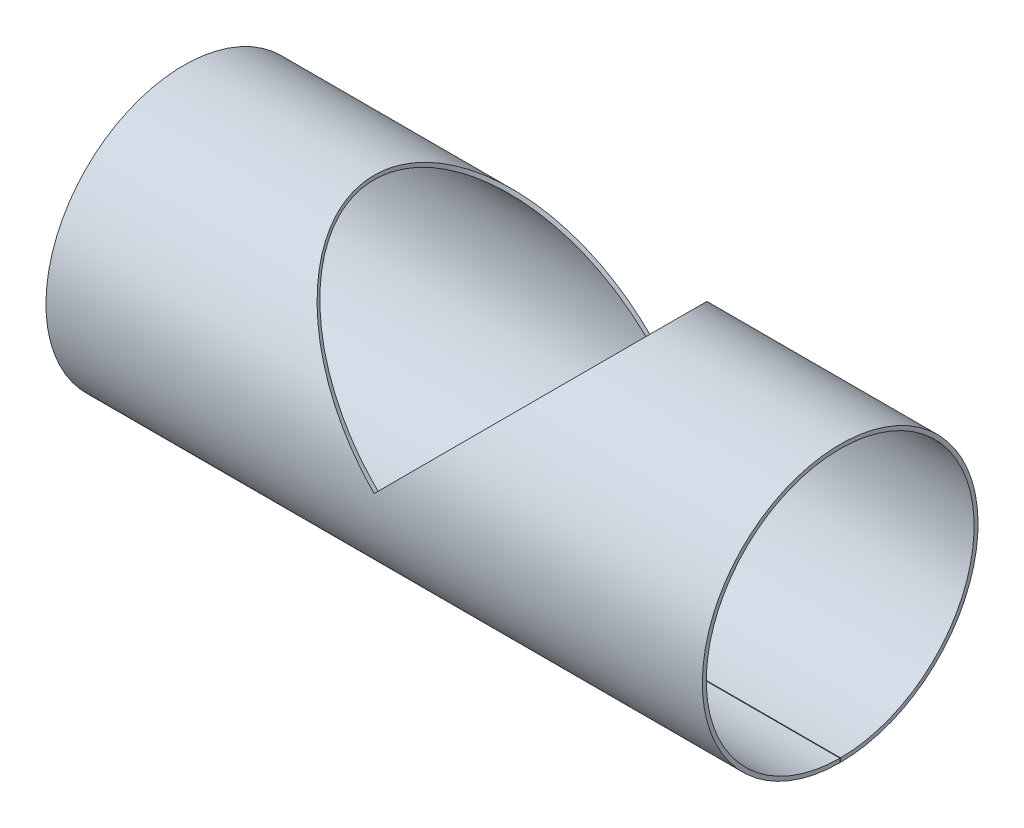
ISO-10303-21;
HEADER;
FILE_DESCRIPTION(('STEP AP214'),'2;1');
FILE_NAME('part.step','',(''),(''),'','','');
FILE_SCHEMA(('AUTOMOTIVE_DESIGN { 1 0 10303 214 1 1 1 1 }'));
ENDSEC;
DATA;
#1=APPLICATION_CONTEXT('core data for automotive mechanical design processes');
#2=APPLICATION_PROTOCOL_DEFINITION('international standard','automotive_design',2000,#1);
#3=PRODUCT_CONTEXT('',#1,'mechanical');
#4=PRODUCT('Part','Part','',(#3));
#5=PRODUCT_RELATED_PRODUCT_CATEGORY('part','',(#4));
#6=PRODUCT_DEFINITION_FORMATION('','',#4);
#7=PRODUCT_DEFINITION_CONTEXT('part definition',#1,'design');
#8=PRODUCT_DEFINITION('design','',#6,#7);
#9=PRODUCT_DEFINITION_SHAPE('','',#8);
#10=(LENGTH_UNIT() NAMED_UNIT(*) SI_UNIT(.MILLI.,.METRE.));
#11=(NAMED_UNIT(*) PLANE_ANGLE_UNIT() SI_UNIT($,.RADIAN.));
#12=(NAMED_UNIT(*) SI_UNIT($,.STERADIAN.) SOLID_ANGLE_UNIT());
#13=UNCERTAINTY_MEASURE_WITH_UNIT(LENGTH_MEASURE(1.E-05),#10,'distance_accuracy_value','');
#14=(GEOMETRIC_REPRESENTATION_CONTEXT(3) GLOBAL_UNCERTAINTY_ASSIGNED_CONTEXT((#13)) GLOBAL_UNIT_ASSIGNED_CONTEXT((#10,
#11,#12)) REPRESENTATION_CONTEXT('',''));
#15=CARTESIAN_POINT('',(0.,0.,0.));
#16=DIRECTION('',(0.,0.,1.));
#17=DIRECTION('',(1.,0.,0.));
#18=AXIS2_PLACEMENT_3D('',#15,#16,#17);
#19=CARTESIAN_POINT('',(-3.5527136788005E-12,0.,-210.));
#20=CARTESIAN_POINT('',(6.40118302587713,6.40120471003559,-210.));
#21=CARTESIAN_POINT('',(11.4880524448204,11.4892153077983,-209.719604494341));
#22=CARTESIAN_POINT('',(15.7341108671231,15.7343523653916,-209.410252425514));
#23=CARTESIAN_POINT('',(16.1853768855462,16.1855253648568,-209.375775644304));
#24=CARTESIAN_POINT('',(17.04687242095,17.0468949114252,-209.307405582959));
#25=CARTESIAN_POINT('',(17.4521906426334,17.4521920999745,-209.273933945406));
#26=CARTESIAN_POINT('',(18.6419884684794,18.6419995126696,-209.172439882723));
#27=CARTESIAN_POINT('',(19.4251193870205,19.425164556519,-209.101090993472));
#28=CARTESIAN_POINT('',(21.7443092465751,21.7444804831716,-208.876974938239));
#29=CARTESIAN_POINT('',(23.25016529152,23.2504462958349,-208.714146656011));
#30=CARTESIAN_POINT('',(27.64692184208,27.6473588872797,-208.193027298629));
#31=CARTESIAN_POINT('',(30.4170107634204,30.4172486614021,-207.802236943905));
#32=CARTESIAN_POINT('',(34.3305209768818,34.3305216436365,-207.179052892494));
#33=CARTESIAN_POINT('',(35.5880096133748,35.5880007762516,-206.966399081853));
#34=CARTESIAN_POINT('',(38.0755543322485,38.075608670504,-206.523229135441));
#35=CARTESIAN_POINT('',(39.30158276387,39.3016920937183,-206.293222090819));
#36=CARTESIAN_POINT('',(42.9264362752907,42.9266683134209,-205.580561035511));
#37=CARTESIAN_POINT('',(45.2720295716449,45.2722639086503,-205.075291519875));
#38=CARTESIAN_POINT('',(48.683955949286,48.6840733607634,-204.282217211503));
#39=CARTESIAN_POINT('',(49.8035208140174,49.8035851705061,-204.011991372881));
#40=CARTESIAN_POINT('',(52.0071626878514,52.0071592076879,-203.461409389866));
#41=CARTESIAN_POINT('',(53.0893723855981,53.0893689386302,-203.181574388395));
#42=CARTESIAN_POINT('',(58.4540241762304,58.4541330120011,-201.749464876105));
#43=CARTESIAN_POINT('',(62.5722640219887,62.5724892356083,-200.504311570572));
#44=CARTESIAN_POINT('',(68.4894014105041,68.4894394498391,-198.528387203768));
#45=CARTESIAN_POINT('',(70.4147946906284,70.414796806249,-197.853061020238));
#46=CARTESIAN_POINT('',(74.2062705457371,74.2063254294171,-196.462461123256));
#47=CARTESIAN_POINT('',(76.0704362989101,76.0705334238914,-195.74771588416));
#48=CARTESIAN_POINT('',(79.7356234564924,79.7357234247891,-194.283578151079));
#49=CARTESIAN_POINT('',(81.5366448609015,81.536705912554,-193.534185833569));
#50=CARTESIAN_POINT('',(85.0755433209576,85.0755185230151,-192.004874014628));
#51=CARTESIAN_POINT('',(86.8112773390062,86.8112304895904,-191.225961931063));
#52=CARTESIAN_POINT('',(91.9428384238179,91.9428889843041,-188.840509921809));
#53=CARTESIAN_POINT('',(95.2633141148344,95.2634531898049,-187.184841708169));
#54=CARTESIAN_POINT('',(101.703135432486,101.703170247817,-183.765490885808));
#55=CARTESIAN_POINT('',(104.818438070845,104.818454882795,-182.004360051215));
#56=CARTESIAN_POINT('',(110.884529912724,110.884653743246,-178.373454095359));
#57=CARTESIAN_POINT('',(113.831941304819,113.832038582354,-176.505282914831));
#58=CARTESIAN_POINT('',(119.555495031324,119.555479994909,-172.679863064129));
#59=CARTESIAN_POINT('',(122.331483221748,122.331532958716,-170.722919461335));
#60=CARTESIAN_POINT('',(127.737513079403,127.737634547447,-166.716573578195));
#61=CARTESIAN_POINT('',(130.364390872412,130.364462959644,-164.669247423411));
#62=CARTESIAN_POINT('',(135.465872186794,135.465851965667,-160.498776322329));
#63=CARTESIAN_POINT('',(137.940944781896,137.940979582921,-158.375356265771));
#64=CARTESIAN_POINT('',(145.160933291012,145.160980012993,-151.888640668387));
#65=CARTESIAN_POINT('',(149.687226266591,149.687372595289,-147.420987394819));
#66=CARTESIAN_POINT('',(158.209949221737,158.210170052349,-138.234580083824));
#67=CARTESIAN_POINT('',(162.20356742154,162.203411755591,-133.518806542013));
#68=CARTESIAN_POINT('',(173.419790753,173.419804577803,-119.056479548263));
#69=CARTESIAN_POINT('',(179.88941666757,179.889437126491,-108.98421016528));
#70=CARTESIAN_POINT('',(190.914037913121,190.913876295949,-88.2590476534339));
#71=CARTESIAN_POINT('',(195.470442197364,195.470433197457,-77.6040173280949));
#72=CARTESIAN_POINT('',(202.74816525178,202.748455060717,-55.893986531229));
#73=CARTESIAN_POINT('',(205.467275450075,205.467311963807,-44.8423903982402));
#74=CARTESIAN_POINT('',(208.186247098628,208.186235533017,-28.1141494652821));
#75=CARTESIAN_POINT('',(208.865157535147,208.86522442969,-22.5171628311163));
#76=CARTESIAN_POINT('',(209.77155537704,209.771751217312,-11.2923420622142));
#77=CARTESIAN_POINT('',(209.998768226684,209.998774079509,-5.66656357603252));
#78=CARTESIAN_POINT('',(210.001221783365,210.001216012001,5.57533237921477));
#79=CARTESIAN_POINT('',(209.776445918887,209.776641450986,11.2011965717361));
#80=CARTESIAN_POINT('',(208.874888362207,208.874963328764,22.426676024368));
#81=CARTESIAN_POINT('',(208.198396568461,208.198378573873,28.0241312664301));
#82=CARTESIAN_POINT('',(205.486512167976,205.486554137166,44.754253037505));
#83=CARTESIAN_POINT('',(202.771957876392,202.772238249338,55.8078301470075));
#84=CARTESIAN_POINT('',(195.502778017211,195.502774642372,77.5226393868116));
#85=CARTESIAN_POINT('',(190.950453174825,190.950294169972,88.1803455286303));
#86=CARTESIAN_POINT('',(179.933483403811,179.933494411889,108.911550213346));
#87=CARTESIAN_POINT('',(173.4673043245,173.467333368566,118.987429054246));
#88=CARTESIAN_POINT('',(162.254833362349,162.254678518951,133.456548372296));
#89=CARTESIAN_POINT('',(158.262363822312,158.262579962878,138.174641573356));
#90=CARTESIAN_POINT('',(149.741008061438,149.741164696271,147.366412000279));
#91=CARTESIAN_POINT('',(145.215176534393,145.215220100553,151.836866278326));
#92=CARTESIAN_POINT('',(137.995298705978,137.995336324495,158.32801609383));
#93=CARTESIAN_POINT('',(135.520159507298,135.520138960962,160.452961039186));
#94=CARTESIAN_POINT('',(130.418540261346,130.418609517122,164.626386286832));
#95=CARTESIAN_POINT('',(127.791496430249,127.791618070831,166.675220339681));
#96=CARTESIAN_POINT('',(122.384940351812,122.384992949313,170.684622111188));
#97=CARTESIAN_POINT('',(119.608597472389,119.608581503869,172.643108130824));
#98=CARTESIAN_POINT('',(113.884354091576,113.884449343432,176.471492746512));
#99=CARTESIAN_POINT('',(110.936489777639,110.936614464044,178.341167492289));
#100=CARTESIAN_POINT('',(104.869275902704,104.869294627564,181.975095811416));
#101=CARTESIAN_POINT('',(101.75340927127,101.753441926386,183.737685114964));
#102=CARTESIAN_POINT('',(95.3122230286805,95.3123637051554,187.159966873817));
#103=CARTESIAN_POINT('',(91.9908923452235,91.99094836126,188.817134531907));
#104=CARTESIAN_POINT('',(86.8577899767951,86.8577434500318,191.204847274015));
#105=CARTESIAN_POINT('',(85.1216152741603,85.1215872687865,191.98446301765));
#106=CARTESIAN_POINT('',(81.5815705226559,81.5816303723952,193.515261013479));
#107=CARTESIAN_POINT('',(79.7798661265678,79.7799680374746,194.265424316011));
#108=CARTESIAN_POINT('',(76.1130932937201,76.1131966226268,195.731141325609));
#109=CARTESIAN_POINT('',(74.2480248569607,74.2480870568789,196.446694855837));
#110=CARTESIAN_POINT('',(70.45452394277,70.4545280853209,197.838928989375));
#111=CARTESIAN_POINT('',(68.5281306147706,68.528162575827,198.515037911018));
#112=CARTESIAN_POINT('',(62.6076075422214,62.6078229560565,200.493336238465));
#113=CARTESIAN_POINT('',(58.4864683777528,58.4865781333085,201.740145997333));
#114=CARTESIAN_POINT('',(53.1173896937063,53.1173868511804,203.174256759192));
#115=CARTESIAN_POINT('',(52.0343198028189,52.0343157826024,203.454471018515));
#116=CARTESIAN_POINT('',(49.8289765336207,49.8290395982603,204.005780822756));
#117=CARTESIAN_POINT('',(48.7085187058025,48.7086349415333,204.276367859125));
#118=CARTESIAN_POINT('',(45.2937866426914,45.29402065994,205.070509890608));
#119=CARTESIAN_POINT('',(42.9461538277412,42.9463866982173,205.57647018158));
#120=CARTESIAN_POINT('',(39.3179874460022,39.3180978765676,206.290102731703));
#121=CARTESIAN_POINT('',(38.0908124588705,38.0908677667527,206.520422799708));
#122=CARTESIAN_POINT('',(35.6008900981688,35.6008814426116,206.964191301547));
#123=CARTESIAN_POINT('',(34.3422807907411,34.3422806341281,207.177111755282));
#124=CARTESIAN_POINT('',(30.4252151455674,30.4254515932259,207.801066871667));
#125=CARTESIAN_POINT('',(27.6523698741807,27.6528066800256,208.192348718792));
#126=CARTESIAN_POINT('',(23.2508997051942,23.2511807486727,208.714076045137));
#127=CARTESIAN_POINT('',(21.7433759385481,21.7435471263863,208.877085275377));
#128=CARTESIAN_POINT('',(19.4215397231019,19.4215847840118,209.101426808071));
#129=CARTESIAN_POINT('',(18.6375025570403,18.63751349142,209.172843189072));
#130=CARTESIAN_POINT('',(17.4463091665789,17.4463106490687,209.274425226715));
#131=CARTESIAN_POINT('',(17.0403066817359,17.0403296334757,209.307941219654));
#132=CARTESIAN_POINT('',(16.1778093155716,16.1779578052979,209.376361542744));
#133=CARTESIAN_POINT('',(15.7261271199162,15.7263680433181,209.410852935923));
#134=CARTESIAN_POINT('',(11.4770857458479,11.4782407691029,209.720253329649));
#135=CARTESIAN_POINT('',(6.39298534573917,6.39298885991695,210.));
#136=CARTESIAN_POINT('',(-3.5527136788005E-12,2.85123518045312E-12,210.));
#137=CARTESIAN_POINT('',(-3.5527136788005E-12,0.,-204.));
#138=CARTESIAN_POINT('',(6.40116642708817,6.21829702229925,-204.));
#139=CARTESIAN_POINT('',(11.4880524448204,11.1609520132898,-203.727615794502));
#140=CARTESIAN_POINT('',(15.7341108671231,15.2847994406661,-203.427102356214));
#141=CARTESIAN_POINT('',(16.1853768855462,15.7230817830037,-203.393610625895));
#142=CARTESIAN_POINT('',(17.04687242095,16.5598407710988,-203.327193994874));
#143=CARTESIAN_POINT('',(17.4521906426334,16.9535580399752,-203.294678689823));
#144=CARTESIAN_POINT('',(18.6419884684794,18.1093709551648,-203.196084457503));
#145=CARTESIAN_POINT('',(19.4251193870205,18.8701598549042,-203.126774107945));
#146=CARTESIAN_POINT('',(21.7443092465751,21.1232096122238,-202.909061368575));
#147=CARTESIAN_POINT('',(23.25016529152,22.5861478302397,-202.750885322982));
#148=CARTESIAN_POINT('',(27.64692184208,26.8574343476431,-202.244655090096));
#149=CARTESIAN_POINT('',(30.4170107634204,29.5481844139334,-201.865030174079));
#150=CARTESIAN_POINT('',(34.3305209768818,33.3496495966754,-201.25965138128));
#151=CARTESIAN_POINT('',(35.5880096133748,34.571200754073,-201.0530733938));
#152=CARTESIAN_POINT('',(38.0755543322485,36.9877341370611,-200.622565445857));
#153=CARTESIAN_POINT('',(39.30158276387,38.1787866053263,-200.399130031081));
#154=CARTESIAN_POINT('',(42.9264362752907,41.7001920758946,-199.706830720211));
#155=CARTESIAN_POINT('',(45.2720295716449,43.9787706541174,-199.21599747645));
#156=CARTESIAN_POINT('',(48.683955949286,47.2930998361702,-198.445582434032));
#157=CARTESIAN_POINT('',(49.8035208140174,48.380625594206,-198.183077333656));
#158=CARTESIAN_POINT('',(52.0071626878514,50.5212403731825,-197.648226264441));
#159=CARTESIAN_POINT('',(53.0893723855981,51.5725298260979,-197.376386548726));
#160=CARTESIAN_POINT('',(58.4540241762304,56.7840149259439,-195.985194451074));
#161=CARTESIAN_POINT('',(62.5722640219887,60.7847038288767,-194.77561695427));
#162=CARTESIAN_POINT('',(68.4894014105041,66.5325983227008,-192.856147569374));
#163=CARTESIAN_POINT('',(70.4147946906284,68.4029454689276,-192.20011641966));
#164=CARTESIAN_POINT('',(74.2062705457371,72.0861447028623,-190.849247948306));
#165=CARTESIAN_POINT('',(76.0704362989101,73.8970896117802,-190.154924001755));
#166=CARTESIAN_POINT('',(79.7356234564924,77.4575598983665,-188.732618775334));
#167=CARTESIAN_POINT('',(81.5366448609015,79.2070857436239,-188.004637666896));
#168=CARTESIAN_POINT('',(85.0755433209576,82.6447894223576,-186.519020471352));
#169=CARTESIAN_POINT('',(86.8112773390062,84.3309096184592,-185.762363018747));
#170=CARTESIAN_POINT('',(91.9428384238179,89.3159492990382,-183.445066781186));
#171=CARTESIAN_POINT('',(95.2633141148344,92.5416402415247,-181.83670337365));
#172=CARTESIAN_POINT('',(101.703135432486,98.7973653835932,-178.515048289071));
#173=CARTESIAN_POINT('',(104.818438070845,101.823641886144,-176.804235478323));
#174=CARTESIAN_POINT('',(110.884529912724,107.716520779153,-173.277069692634));
#175=CARTESIAN_POINT('',(113.831941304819,110.579694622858,-171.462274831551));
#176=CARTESIAN_POINT('',(119.555495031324,116.139609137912,-167.746152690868));
#177=CARTESIAN_POINT('',(122.331483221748,118.836346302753,-165.845121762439));
#178=CARTESIAN_POINT('',(127.737513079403,124.087987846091,-161.953242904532));
#179=CARTESIAN_POINT('',(130.364390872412,126.63976401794,-159.964411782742));
#180=CARTESIAN_POINT('',(135.465872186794,131.595399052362,-155.913096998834));
#181=CARTESIAN_POINT('',(137.940944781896,133.999808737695,-153.850346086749));
#182=CARTESIAN_POINT('',(145.160933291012,141.013523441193,-147.548965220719));
#183=CARTESIAN_POINT('',(149.687226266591,145.410590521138,-143.208959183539));
#184=CARTESIAN_POINT('',(158.209949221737,153.689879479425,-134.285020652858));
#185=CARTESIAN_POINT('',(162.20356742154,157.569028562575,-129.703983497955));
#186=CARTESIAN_POINT('',(173.419790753,168.464953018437,-115.654865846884));
#187=CARTESIAN_POINT('',(179.88941666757,174.749738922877,-105.87037558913));
#188=CARTESIAN_POINT('',(190.914037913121,185.459194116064,-85.7373605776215));
#189=CARTESIAN_POINT('',(195.470442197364,189.88556367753,-75.3867596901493));
#190=CARTESIAN_POINT('',(202.74816525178,196.955642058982,-54.2970154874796));
#191=CARTESIAN_POINT('',(205.467275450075,199.59681733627,-43.5611792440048));
#192=CARTESIAN_POINT('',(208.186247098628,202.238057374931,-27.3108880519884));
#193=CARTESIAN_POINT('',(208.865157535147,202.897646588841,-21.8738153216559));
#194=CARTESIAN_POINT('',(209.77155537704,203.778272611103,-10.9697037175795));
#195=CARTESIAN_POINT('',(209.998768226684,203.998809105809,-5.50466175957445));
#196=CARTESIAN_POINT('',(210.001221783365,204.001181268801,5.41603716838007));
#197=CARTESIAN_POINT('',(209.776445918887,203.783023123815,10.8811623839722));
#198=CARTESIAN_POINT('',(208.874888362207,202.907107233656,21.7859138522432));
#199=CARTESIAN_POINT('',(208.198396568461,202.249853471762,27.223441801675));
#200=CARTESIAN_POINT('',(205.486512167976,199.615509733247,43.4755600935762));
#201=CARTESIAN_POINT('',(202.771957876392,196.978745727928,54.2133207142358));
#202=CARTESIAN_POINT('',(195.502778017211,189.916981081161,75.3077068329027));
#203=CARTESIAN_POINT('',(190.950453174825,185.494571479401,85.6609070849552));
#204=CARTESIAN_POINT('',(179.933483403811,174.792537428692,105.799791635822));
#205=CARTESIAN_POINT('',(173.4673043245,168.51112384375,115.587788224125));
#206=CARTESIAN_POINT('',(162.254833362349,157.618830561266,129.643504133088));
#207=CARTESIAN_POINT('',(158.262363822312,153.740791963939,134.22679467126));
#208=CARTESIAN_POINT('',(149.741008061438,145.462845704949,143.155943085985));
#209=CARTESIAN_POINT('',(145.215176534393,141.066213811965,147.498670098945));
#210=CARTESIAN_POINT('',(137.995298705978,134.05261242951,153.804358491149));
#211=CARTESIAN_POINT('',(135.520159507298,131.648134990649,155.868590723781));
#212=CARTESIAN_POINT('',(130.418540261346,126.692363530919,159.922775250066));
#213=CARTESIAN_POINT('',(127.791496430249,124.140428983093,161.913071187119));
#214=CARTESIAN_POINT('',(122.384940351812,118.888278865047,165.807918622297));
#215=CARTESIAN_POINT('',(119.608597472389,116.191193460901,167.710447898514));
#216=CARTESIAN_POINT('',(113.884354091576,110.63060793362,171.429450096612));
#217=CARTESIAN_POINT('',(110.936489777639,107.766996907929,173.245705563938));
#218=CARTESIAN_POINT('',(104.869275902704,101.873029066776,176.775807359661));
#219=CARTESIAN_POINT('',(101.75340927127,98.8462007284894,178.488036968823));
#220=CARTESIAN_POINT('',(95.3122230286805,92.5891533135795,181.812539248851));
#221=CARTESIAN_POINT('',(91.9908923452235,89.3626355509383,183.422359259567));
#222=CARTESIAN_POINT('',(86.8577899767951,84.3760936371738,185.741851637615));
#223=CARTESIAN_POINT('',(85.1216152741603,82.6895419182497,186.499192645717));
#224=CARTESIAN_POINT('',(81.5815705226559,79.2507266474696,187.986253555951));
#225=CARTESIAN_POINT('',(79.7798661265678,77.500540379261,188.714983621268));
#226=CARTESIAN_POINT('',(76.1130932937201,73.9385338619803,190.13882300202));
#227=CARTESIAN_POINT('',(74.2480248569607,72.126713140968,190.833932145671));
#228=CARTESIAN_POINT('',(70.45452394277,68.4415415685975,192.186388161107));
#229=CARTESIAN_POINT('',(68.5281306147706,66.5702150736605,192.843179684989));
#230=CARTESIAN_POINT('',(62.6076075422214,60.8190280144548,194.76495520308));
#231=CARTESIAN_POINT('',(58.4864683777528,56.8155330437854,195.976141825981));
#232=CARTESIAN_POINT('',(53.1173896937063,51.599747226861,197.369277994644));
#233=CARTESIAN_POINT('',(52.0343198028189,50.5476210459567,197.641486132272));
#234=CARTESIAN_POINT('',(49.8289765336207,48.4053527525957,198.17704422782));
#235=CARTESIAN_POINT('',(48.7085187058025,47.3169596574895,198.439900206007));
#236=CARTESIAN_POINT('',(45.2937866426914,43.9999057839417,199.211352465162));
#237=CARTESIAN_POINT('',(42.9461538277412,41.7193470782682,199.702856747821));
#238=CARTESIAN_POINT('',(39.3179874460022,38.1947236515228,200.396099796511));
#239=CARTESIAN_POINT('',(38.0908124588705,37.0025572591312,200.619839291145));
#240=CARTESIAN_POINT('',(35.6008900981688,34.5837134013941,201.050928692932));
#241=CARTESIAN_POINT('',(34.3422807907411,33.3610726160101,201.257765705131));
#242=CARTESIAN_POINT('',(30.4252151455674,29.5561529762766,201.863893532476));
#243=CARTESIAN_POINT('',(27.6523698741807,26.8627264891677,202.243995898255));
#244=CARTESIAN_POINT('',(23.2508997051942,22.5868612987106,202.750816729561));
#245=CARTESIAN_POINT('',(21.7433759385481,21.1223029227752,202.909168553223));
#246=CARTESIAN_POINT('',(19.4215397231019,18.8666823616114,203.12710032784));
#247=CARTESIAN_POINT('',(18.6375025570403,18.1050131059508,203.196476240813));
#248=CARTESIAN_POINT('',(17.4463091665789,16.9478446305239,203.295155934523));
#249=CARTESIAN_POINT('',(17.0403066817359,16.5534630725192,203.327714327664));
#250=CARTESIAN_POINT('',(16.1778093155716,15.7157304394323,203.394179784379));
#251=CARTESIAN_POINT('',(15.7261271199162,15.2770432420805,203.427685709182));
#252=CARTESIAN_POINT('',(11.4770857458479,11.1502910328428,203.728246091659));
#253=CARTESIAN_POINT('',(6.39296882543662,6.21031598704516,204.));
#254=CARTESIAN_POINT('',(-3.5527136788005E-12,2.77056433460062E-12,204.));
#255=B_SPLINE_SURFACE_WITH_KNOTS('',1,3,((#19,#20,#21,#22,#23,#24,#25,#26,#27,#28,#29,#30,#31,
#32,#33,#34,#35,#36,#37,#38,#39,#40,#41,#42,#43,#44,#45,#46,#47,#48,#49,#50,#51,#52,#53,#54,#55,
#56,#57,#58,#59,#60,#61,#62,#63,#64,#65,#66,#67,#68,#69,#70,#71,#72,#73,#74,#75,#76,#77,#78,#79,
#80,#81,#82,#83,#84,#85,#86,#87,#88,#89,#90,#91,#92,#93,#94,#95,#96,#97,#98,#99,#100,#101,#102,
#103,#104,#105,#106,#107,#108,#109,#110,#111,#112,#113,#114,#115,#116,#117,#118,#119,#120,#121,
#122,#123,#124,#125,#126,#127,#128,#129,#130,#131,#132,#133,#134,#135,#136),(#137,#138,#139,
#140,#141,#142,#143,#144,#145,#146,#147,#148,#149,#150,#151,#152,#153,#154,#155,#156,#157,#158,
#159,#160,#161,#162,#163,#164,#165,#166,#167,#168,#169,#170,#171,#172,#173,#174,#175,#176,#177,
#178,#179,#180,#181,#182,#183,#184,#185,#186,#187,#188,#189,#190,#191,#192,#193,#194,#195,#196,
#197,#198,#199,#200,#201,#202,#203,#204,#205,#206,#207,#208,#209,#210,#211,#212,#213,#214,#215,
#216,#217,#218,#219,#220,#221,#222,#223,#224,#225,#226,#227,#228,#229,#230,#231,#232,#233,#234,
#235,#236,#237,#238,#239,#240,#241,#242,#243,#244,#245,#246,#247,#248,#249,#250,#251,#252,#253,
#254)),.UNSPECIFIED.,.F.,.F.,.F.,(2,2),(4,2,2,2,2,2,2,2,2,2,2,2,2,2,2,2,2,2,2,2,2,2,2,2,2,2,2,2,
2,2,2,2,2,2,2,2,2,2,2,2,2,2,2,2,2,2,2,2,2,2,2,2,2,2,2,2,2,2,4),(0.,1.),(0.,0.0078125,
0.0087890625,0.009765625,0.01171875,0.015625,0.0234375,0.02734375,0.03125,0.0390625,0.04296875,
0.046875,0.0625,0.0703125,0.078125,0.0859375,0.09375,0.109375,0.125,0.140625,0.15625,0.171875,
0.1875,0.21875,0.25,0.3125,0.375,0.4375,0.46875,0.5,0.53125,0.5625,0.625,0.6875,0.75,0.78125,
0.8125,0.828125,0.84375,0.859375,0.875,0.890625,0.90625,0.9140625,0.921875,0.9296875,0.9375,
0.953125,0.95703125,0.9609375,0.96875,0.97265625,0.9765625,0.984375,0.98828125,0.990234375,
0.9912109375,0.9921875,1.),.UNSPECIFIED.);
#256=CARTESIAN_POINT('',(-3.5527136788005E-12,0.,-204.));
#257=CARTESIAN_POINT('',(-3.5527136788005E-12,0.,-210.));
#258=B_SPLINE_CURVE_WITH_KNOTS('',1,(#256,#257),.UNSPECIFIED.,.F.,.F.,(2,2),(0.,1.),.UNSPECIFIED.);
#259=CARTESIAN_POINT('',(-3.5527136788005E-12,0.,-204.));
#260=VERTEX_POINT('',#259);
#261=CARTESIAN_POINT('',(2.55448995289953E-07,2.55453533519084E-07,-210.));
#262=VERTEX_POINT('',#261);
#263=EDGE_CURVE('E13',#260,#262,#258,.T.);
#264=CARTESIAN_POINT('',(-3.5527136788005E-12,0.,-204.));
#265=CARTESIAN_POINT('',(6.40116642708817,6.21829702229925,-204.));
#266=CARTESIAN_POINT('',(11.4880524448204,11.1609520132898,-203.727615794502));
#267=CARTESIAN_POINT('',(15.7341108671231,15.2847994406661,-203.427102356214));
#268=CARTESIAN_POINT('',(16.1853768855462,15.7230817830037,-203.393610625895));
#269=CARTESIAN_POINT('',(17.04687242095,16.5598407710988,-203.327193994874));
#270=CARTESIAN_POINT('',(17.4521906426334,16.9535580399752,-203.294678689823));
#271=CARTESIAN_POINT('',(18.6419884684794,18.1093709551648,-203.196084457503));
#272=CARTESIAN_POINT('',(19.4251193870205,18.8701598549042,-203.126774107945));
#273=CARTESIAN_POINT('',(21.7443092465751,21.1232096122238,-202.909061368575));
#274=CARTESIAN_POINT('',(23.25016529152,22.5861478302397,-202.750885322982));
#275=CARTESIAN_POINT('',(27.64692184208,26.8574343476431,-202.244655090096));
#276=CARTESIAN_POINT('',(30.4170107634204,29.5481844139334,-201.865030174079));
#277=CARTESIAN_POINT('',(34.3305209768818,33.3496495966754,-201.25965138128));
#278=CARTESIAN_POINT('',(35.5880096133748,34.571200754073,-201.0530733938));
#279=CARTESIAN_POINT('',(38.0755543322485,36.9877341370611,-200.622565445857));
#280=CARTESIAN_POINT('',(39.30158276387,38.1787866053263,-200.399130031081));
#281=CARTESIAN_POINT('',(42.9264362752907,41.7001920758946,-199.706830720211));
#282=CARTESIAN_POINT('',(45.2720295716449,43.9787706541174,-199.21599747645));
#283=CARTESIAN_POINT('',(48.683955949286,47.2930998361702,-198.445582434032));
#284=CARTESIAN_POINT('',(49.8035208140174,48.380625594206,-198.183077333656));
#285=CARTESIAN_POINT('',(52.0071626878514,50.5212403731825,-197.648226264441));
#286=CARTESIAN_POINT('',(53.0893723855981,51.5725298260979,-197.376386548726));
#287=CARTESIAN_POINT('',(58.4540241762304,56.7840149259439,-195.985194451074));
#288=CARTESIAN_POINT('',(62.5722640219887,60.7847038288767,-194.77561695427));
#289=CARTESIAN_POINT('',(68.4894014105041,66.5325983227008,-192.856147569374));
#290=CARTESIAN_POINT('',(70.4147946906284,68.4029454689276,-192.20011641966));
#291=CARTESIAN_POINT('',(74.2062705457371,72.0861447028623,-190.849247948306));
#292=CARTESIAN_POINT('',(76.0704362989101,73.8970896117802,-190.154924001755));
#293=CARTESIAN_POINT('',(79.7356234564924,77.4575598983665,-188.732618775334));
#294=CARTESIAN_POINT('',(81.5366448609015,79.2070857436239,-188.004637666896));
#295=CARTESIAN_POINT('',(85.0755433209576,82.6447894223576,-186.519020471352));
#296=CARTESIAN_POINT('',(86.8112773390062,84.3309096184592,-185.762363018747));
#297=CARTESIAN_POINT('',(91.9428384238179,89.3159492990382,-183.445066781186));
#298=CARTESIAN_POINT('',(95.2633141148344,92.5416402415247,-181.83670337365));
#299=CARTESIAN_POINT('',(101.703135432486,98.7973653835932,-178.515048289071));
#300=CARTESIAN_POINT('',(104.818438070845,101.823641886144,-176.804235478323));
#301=CARTESIAN_POINT('',(110.884529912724,107.716520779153,-173.277069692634));
#302=CARTESIAN_POINT('',(113.831941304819,110.579694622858,-171.462274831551));
#303=CARTESIAN_POINT('',(119.555495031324,116.139609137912,-167.746152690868));
#304=CARTESIAN_POINT('',(122.331483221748,118.836346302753,-165.845121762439));
#305=CARTESIAN_POINT('',(127.737513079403,124.087987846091,-161.953242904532));
#306=CARTESIAN_POINT('',(130.364390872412,126.63976401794,-159.964411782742));
#307=CARTESIAN_POINT('',(135.465872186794,131.595399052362,-155.913096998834));
#308=CARTESIAN_POINT('',(137.940944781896,133.999808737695,-153.850346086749));
#309=CARTESIAN_POINT('',(145.160933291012,141.013523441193,-147.548965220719));
#310=CARTESIAN_POINT('',(149.687226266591,145.410590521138,-143.208959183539));
#311=CARTESIAN_POINT('',(158.209949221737,153.689879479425,-134.285020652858));
#312=CARTESIAN_POINT('',(162.20356742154,157.569028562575,-129.703983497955));
#313=CARTESIAN_POINT('',(173.419790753,168.464953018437,-115.654865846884));
#314=CARTESIAN_POINT('',(179.88941666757,174.749738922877,-105.87037558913));
#315=CARTESIAN_POINT('',(190.914037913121,185.459194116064,-85.7373605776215));
#316=CARTESIAN_POINT('',(195.470442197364,189.88556367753,-75.3867596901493));
#317=CARTESIAN_POINT('',(202.74816525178,196.955642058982,-54.2970154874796));
#318=CARTESIAN_POINT('',(205.467275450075,199.59681733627,-43.5611792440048));
#319=CARTESIAN_POINT('',(208.186247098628,202.238057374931,-27.3108880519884));
#320=CARTESIAN_POINT('',(208.865157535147,202.897646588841,-21.8738153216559));
#321=CARTESIAN_POINT('',(209.77155537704,203.778272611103,-10.9697037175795));
#322=CARTESIAN_POINT('',(209.998768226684,203.998809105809,-5.50466175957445));
#323=CARTESIAN_POINT('',(210.001221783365,204.001181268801,5.41603716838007));
#324=CARTESIAN_POINT('',(209.776445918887,203.783023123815,10.8811623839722));
#325=CARTESIAN_POINT('',(208.874888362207,202.907107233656,21.7859138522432));
#326=CARTESIAN_POINT('',(208.198396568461,202.249853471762,27.223441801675));
#327=CARTESIAN_POINT('',(205.486512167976,199.615509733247,43.4755600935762));
#328=CARTESIAN_POINT('',(202.771957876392,196.978745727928,54.2133207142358));
#329=CARTESIAN_POINT('',(195.502778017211,189.916981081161,75.3077068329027));
#330=CARTESIAN_POINT('',(190.950453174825,185.494571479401,85.6609070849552));
#331=CARTESIAN_POINT('',(179.933483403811,174.792537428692,105.799791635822));
#332=CARTESIAN_POINT('',(173.4673043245,168.51112384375,115.587788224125));
#333=CARTESIAN_POINT('',(162.254833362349,157.618830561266,129.643504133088));
#334=CARTESIAN_POINT('',(158.262363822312,153.740791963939,134.22679467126));
#335=CARTESIAN_POINT('',(149.741008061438,145.462845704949,143.155943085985));
#336=CARTESIAN_POINT('',(145.215176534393,141.066213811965,147.498670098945));
#337=CARTESIAN_POINT('',(137.995298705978,134.05261242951,153.804358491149));
#338=CARTESIAN_POINT('',(135.520159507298,131.648134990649,155.868590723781));
#339=CARTESIAN_POINT('',(130.418540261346,126.692363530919,159.922775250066));
#340=CARTESIAN_POINT('',(127.791496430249,124.140428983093,161.913071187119));
#341=CARTESIAN_POINT('',(122.384940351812,118.888278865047,165.807918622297));
#342=CARTESIAN_POINT('',(119.608597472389,116.191193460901,167.710447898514));
#343=CARTESIAN_POINT('',(113.884354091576,110.63060793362,171.429450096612));
#344=CARTESIAN_POINT('',(110.936489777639,107.766996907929,173.245705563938));
#345=CARTESIAN_POINT('',(104.869275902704,101.873029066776,176.775807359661));
#346=CARTESIAN_POINT('',(101.75340927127,98.8462007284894,178.488036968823));
#347=CARTESIAN_POINT('',(95.3122230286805,92.5891533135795,181.812539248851));
#348=CARTESIAN_POINT('',(91.9908923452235,89.3626355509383,183.422359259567));
#349=CARTESIAN_POINT('',(86.8577899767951,84.3760936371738,185.741851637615));
#350=CARTESIAN_POINT('',(85.1216152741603,82.6895419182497,186.499192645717));
#351=CARTESIAN_POINT('',(81.5815705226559,79.2507266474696,187.986253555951));
#352=CARTESIAN_POINT('',(79.7798661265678,77.500540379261,188.714983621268));
#353=CARTESIAN_POINT('',(76.1130932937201,73.9385338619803,190.13882300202));
#354=CARTESIAN_POINT('',(74.2480248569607,72.126713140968,190.833932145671));
#355=CARTESIAN_POINT('',(70.45452394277,68.4415415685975,192.186388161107));
#356=CARTESIAN_POINT('',(68.5281306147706,66.5702150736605,192.843179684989));
#357=CARTESIAN_POINT('',(62.6076075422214,60.8190280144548,194.76495520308));
#358=CARTESIAN_POINT('',(58.4864683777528,56.8155330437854,195.976141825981));
#359=CARTESIAN_POINT('',(53.1173896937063,51.599747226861,197.369277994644));
#360=CARTESIAN_POINT('',(52.0343198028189,50.5476210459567,197.641486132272));
#361=CARTESIAN_POINT('',(49.8289765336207,48.4053527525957,198.17704422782));
#362=CARTESIAN_POINT('',(48.7085187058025,47.3169596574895,198.439900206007));
#363=CARTESIAN_POINT('',(45.2937866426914,43.9999057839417,199.211352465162));
#364=CARTESIAN_POINT('',(42.9461538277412,41.7193470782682,199.702856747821));
#365=CARTESIAN_POINT('',(39.3179874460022,38.1947236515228,200.396099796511));
#366=CARTESIAN_POINT('',(38.0908124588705,37.0025572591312,200.619839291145));
#367=CARTESIAN_POINT('',(35.6008900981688,34.5837134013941,201.050928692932));
#368=CARTESIAN_POINT('',(34.3422807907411,33.3610726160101,201.257765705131));
#369=CARTESIAN_POINT('',(30.4252151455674,29.5561529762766,201.863893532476));
#370=CARTESIAN_POINT('',(27.6523698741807,26.8627264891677,202.243995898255));
#371=CARTESIAN_POINT('',(23.2508997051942,22.5868612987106,202.750816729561));
#372=CARTESIAN_POINT('',(21.7433759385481,21.1223029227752,202.909168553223));
#373=CARTESIAN_POINT('',(19.4215397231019,18.8666823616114,203.12710032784));
#374=CARTESIAN_POINT('',(18.6375025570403,18.1050131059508,203.196476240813));
#375=CARTESIAN_POINT('',(17.4463091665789,16.9478446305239,203.295155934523));
#376=CARTESIAN_POINT('',(17.0403066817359,16.5534630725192,203.327714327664));
#377=CARTESIAN_POINT('',(16.1778093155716,15.7157304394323,203.394179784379));
#378=CARTESIAN_POINT('',(15.7261271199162,15.2770432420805,203.427685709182));
#379=CARTESIAN_POINT('',(11.4770857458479,11.1502910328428,203.728246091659));
#380=CARTESIAN_POINT('',(6.39296882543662,6.21031598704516,204.));
#381=CARTESIAN_POINT('',(-3.5527136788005E-12,2.77056433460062E-12,204.));
#382=B_SPLINE_CURVE_WITH_KNOTS('',3,(#264,#265,#266,#267,#268,#269,#270,#271,#272,#273,#274,
#275,#276,#277,#278,#279,#280,#281,#282,#283,#284,#285,#286,#287,#288,#289,#290,#291,#292,#293,
#294,#295,#296,#297,#298,#299,#300,#301,#302,#303,#304,#305,#306,#307,#308,#309,#310,#311,#312,
#313,#314,#315,#316,#317,#318,#319,#320,#321,#322,#323,#324,#325,#326,#327,#328,#329,#330,#331,
#332,#333,#334,#335,#336,#337,#338,#339,#340,#341,#342,#343,#344,#345,#346,#347,#348,#349,#350,
#351,#352,#353,#354,#355,#356,#357,#358,#359,#360,#361,#362,#363,#364,#365,#366,#367,#368,#369,
#370,#371,#372,#373,#374,#375,#376,#377,#378,#379,#380,#381),.UNSPECIFIED.,.F.,.F.,(4,2,2,2,2,2,
2,2,2,2,2,2,2,2,2,2,2,2,2,2,2,2,2,2,2,2,2,2,2,2,2,2,2,2,2,2,2,2,2,2,2,2,2,2,2,2,2,2,2,2,2,2,2,2,
2,2,2,2,4),(0.,0.0078125,0.0087890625,0.009765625,0.01171875,0.015625,0.0234375,0.02734375,
0.03125,0.0390625,0.04296875,0.046875,0.0625,0.0703125,0.078125,0.0859375,0.09375,0.109375,
0.125,0.140625,0.15625,0.171875,0.1875,0.21875,0.25,0.3125,0.375,0.4375,0.46875,0.5,0.53125,
0.5625,0.625,0.6875,0.75,0.78125,0.8125,0.828125,0.84375,0.859375,0.875,0.890625,0.90625,
0.9140625,0.921875,0.9296875,0.9375,0.953125,0.95703125,0.9609375,0.96875,0.97265625,0.9765625,
0.984375,0.98828125,0.990234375,0.9912109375,0.9921875,1.),.UNSPECIFIED.);
#383=CARTESIAN_POINT('',(-3.5527136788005E-12,2.77056433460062E-12,204.));
#384=VERTEX_POINT('',#383);
#385=EDGE_CURVE('E250',#260,#384,#382,.T.);
#386=CARTESIAN_POINT('',(-3.5527136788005E-12,2.77056433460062E-12,204.));
#387=CARTESIAN_POINT('',(-3.5527136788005E-12,2.85123518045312E-12,210.));
#388=B_SPLINE_CURVE_WITH_KNOTS('',1,(#386,#387),.UNSPECIFIED.,.F.,.F.,(2,2),(0.,1.),.UNSPECIFIED.);
#389=CARTESIAN_POINT('',(2.55449883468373E-07,2.55456429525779E-07,210.));
#390=VERTEX_POINT('',#389);
#391=EDGE_CURVE('E53',#384,#390,#388,.T.);
#392=CARTESIAN_POINT('',(-3.5527136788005E-12,2.85123518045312E-12,210.));
#393=CARTESIAN_POINT('',(6.39298534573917,6.39298885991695,210.));
#394=CARTESIAN_POINT('',(11.4770857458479,11.4782407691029,209.720253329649));
#395=CARTESIAN_POINT('',(15.7261271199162,15.7263680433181,209.410852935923));
#396=CARTESIAN_POINT('',(16.1778093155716,16.1779578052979,209.376361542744));
#397=CARTESIAN_POINT('',(17.0403066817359,17.0403296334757,209.307941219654));
#398=CARTESIAN_POINT('',(17.4463091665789,17.4463106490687,209.274425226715));
#399=CARTESIAN_POINT('',(18.6375025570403,18.63751349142,209.172843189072));
#400=CARTESIAN_POINT('',(19.4215397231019,19.4215847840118,209.101426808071));
#401=CARTESIAN_POINT('',(21.7433759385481,21.7435471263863,208.877085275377));
#402=CARTESIAN_POINT('',(23.2508997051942,23.2511807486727,208.714076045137));
#403=CARTESIAN_POINT('',(27.6523698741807,27.6528066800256,208.192348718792));
#404=CARTESIAN_POINT('',(30.4252151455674,30.4254515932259,207.801066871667));
#405=CARTESIAN_POINT('',(34.3422807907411,34.3422806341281,207.177111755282));
#406=CARTESIAN_POINT('',(35.6008900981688,35.6008814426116,206.964191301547));
#407=CARTESIAN_POINT('',(38.0908124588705,38.0908677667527,206.520422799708));
#408=CARTESIAN_POINT('',(39.3179874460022,39.3180978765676,206.290102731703));
#409=CARTESIAN_POINT('',(42.9461538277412,42.9463866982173,205.57647018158));
#410=CARTESIAN_POINT('',(45.2937866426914,45.29402065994,205.070509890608));
#411=CARTESIAN_POINT('',(48.7085187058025,48.7086349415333,204.276367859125));
#412=CARTESIAN_POINT('',(49.8289765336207,49.8290395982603,204.005780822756));
#413=CARTESIAN_POINT('',(52.0343198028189,52.0343157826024,203.454471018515));
#414=CARTESIAN_POINT('',(53.1173896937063,53.1173868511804,203.174256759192));
#415=CARTESIAN_POINT('',(58.4864683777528,58.4865781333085,201.740145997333));
#416=CARTESIAN_POINT('',(62.6076075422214,62.6078229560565,200.493336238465));
#417=CARTESIAN_POINT('',(68.5281306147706,68.528162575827,198.515037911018));
#418=CARTESIAN_POINT('',(70.45452394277,70.4545280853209,197.838928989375));
#419=CARTESIAN_POINT('',(74.2480248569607,74.2480870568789,196.446694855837));
#420=CARTESIAN_POINT('',(76.1130932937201,76.1131966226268,195.731141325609));
#421=CARTESIAN_POINT('',(79.7798661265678,79.7799680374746,194.265424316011));
#422=CARTESIAN_POINT('',(81.5815705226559,81.5816303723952,193.515261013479));
#423=CARTESIAN_POINT('',(85.1216152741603,85.1215872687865,191.98446301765));
#424=CARTESIAN_POINT('',(86.8577899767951,86.8577434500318,191.204847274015));
#425=CARTESIAN_POINT('',(91.9908923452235,91.99094836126,188.817134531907));
#426=CARTESIAN_POINT('',(95.3122230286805,95.3123637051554,187.159966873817));
#427=CARTESIAN_POINT('',(101.75340927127,101.753441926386,183.737685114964));
#428=CARTESIAN_POINT('',(104.869275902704,104.869294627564,181.975095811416));
#429=CARTESIAN_POINT('',(110.936489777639,110.936614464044,178.341167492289));
#430=CARTESIAN_POINT('',(113.884354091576,113.884449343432,176.471492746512));
#431=CARTESIAN_POINT('',(119.608597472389,119.608581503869,172.643108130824));
#432=CARTESIAN_POINT('',(122.384940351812,122.384992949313,170.684622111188));
#433=CARTESIAN_POINT('',(127.791496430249,127.791618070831,166.675220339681));
#434=CARTESIAN_POINT('',(130.418540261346,130.418609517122,164.626386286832));
#435=CARTESIAN_POINT('',(135.520159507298,135.520138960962,160.452961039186));
#436=CARTESIAN_POINT('',(137.995298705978,137.995336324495,158.32801609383));
#437=CARTESIAN_POINT('',(145.215176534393,145.215220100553,151.836866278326));
#438=CARTESIAN_POINT('',(149.741008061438,149.741164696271,147.366412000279));
#439=CARTESIAN_POINT('',(158.262363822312,158.262579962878,138.174641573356));
#440=CARTESIAN_POINT('',(162.254833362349,162.254678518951,133.456548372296));
#441=CARTESIAN_POINT('',(173.4673043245,173.467333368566,118.987429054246));
#442=CARTESIAN_POINT('',(179.933483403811,179.933494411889,108.911550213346));
#443=CARTESIAN_POINT('',(190.950453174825,190.950294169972,88.1803455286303));
#444=CARTESIAN_POINT('',(195.502778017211,195.502774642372,77.5226393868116));
#445=CARTESIAN_POINT('',(202.771957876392,202.772238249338,55.8078301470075));
#446=CARTESIAN_POINT('',(205.486512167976,205.486554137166,44.754253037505));
#447=CARTESIAN_POINT('',(208.198396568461,208.198378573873,28.0241312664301));
#448=CARTESIAN_POINT('',(208.874888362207,208.874963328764,22.426676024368));
#449=CARTESIAN_POINT('',(209.776445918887,209.776641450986,11.2011965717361));
#450=CARTESIAN_POINT('',(210.001221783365,210.001216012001,5.57533237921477));
#451=CARTESIAN_POINT('',(209.998768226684,209.998774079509,-5.66656357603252));
#452=CARTESIAN_POINT('',(209.77155537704,209.771751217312,-11.2923420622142));
#453=CARTESIAN_POINT('',(208.865157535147,208.86522442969,-22.5171628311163));
#454=CARTESIAN_POINT('',(208.186247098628,208.186235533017,-28.1141494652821));
#455=CARTESIAN_POINT('',(205.467275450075,205.467311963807,-44.8423903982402));
#456=CARTESIAN_POINT('',(202.74816525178,202.748455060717,-55.893986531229));
#457=CARTESIAN_POINT('',(195.470442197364,195.470433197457,-77.6040173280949));
#458=CARTESIAN_POINT('',(190.914037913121,190.913876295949,-88.2590476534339));
#459=CARTESIAN_POINT('',(179.88941666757,179.889437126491,-108.98421016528));
#460=CARTESIAN_POINT('',(173.419790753,173.419804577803,-119.056479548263));
#461=CARTESIAN_POINT('',(162.20356742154,162.203411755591,-133.518806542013));
#462=CARTESIAN_POINT('',(158.209949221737,158.210170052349,-138.234580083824));
#463=CARTESIAN_POINT('',(149.687226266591,149.687372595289,-147.420987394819));
#464=CARTESIAN_POINT('',(145.160933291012,145.160980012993,-151.888640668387));
#465=CARTESIAN_POINT('',(137.940944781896,137.940979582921,-158.375356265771));
#466=CARTESIAN_POINT('',(135.465872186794,135.465851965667,-160.498776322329));
#467=CARTESIAN_POINT('',(130.364390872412,130.364462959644,-164.669247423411));
#468=CARTESIAN_POINT('',(127.737513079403,127.737634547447,-166.716573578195));
#469=CARTESIAN_POINT('',(122.331483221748,122.331532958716,-170.722919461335));
#470=CARTESIAN_POINT('',(119.555495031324,119.555479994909,-172.679863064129));
#471=CARTESIAN_POINT('',(113.831941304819,113.832038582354,-176.505282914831));
#472=CARTESIAN_POINT('',(110.884529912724,110.884653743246,-178.373454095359));
#473=CARTESIAN_POINT('',(104.818438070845,104.818454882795,-182.004360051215));
#474=CARTESIAN_POINT('',(101.703135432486,101.703170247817,-183.765490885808));
#475=CARTESIAN_POINT('',(95.2633141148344,95.2634531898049,-187.184841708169));
#476=CARTESIAN_POINT('',(91.9428384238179,91.9428889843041,-188.840509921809));
#477=CARTESIAN_POINT('',(86.8112773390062,86.8112304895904,-191.225961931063));
#478=CARTESIAN_POINT('',(85.0755433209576,85.0755185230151,-192.004874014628));
#479=CARTESIAN_POINT('',(81.5366448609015,81.536705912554,-193.534185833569));
#480=CARTESIAN_POINT('',(79.7356234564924,79.7357234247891,-194.283578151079));
#481=CARTESIAN_POINT('',(76.0704362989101,76.0705334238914,-195.74771588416));
#482=CARTESIAN_POINT('',(74.2062705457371,74.2063254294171,-196.462461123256));
#483=CARTESIAN_POINT('',(70.4147946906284,70.414796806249,-197.853061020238));
#484=CARTESIAN_POINT('',(68.4894014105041,68.4894394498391,-198.528387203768));
#485=CARTESIAN_POINT('',(62.5722640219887,62.5724892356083,-200.504311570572));
#486=CARTESIAN_POINT('',(58.4540241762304,58.4541330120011,-201.749464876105));
#487=CARTESIAN_POINT('',(53.0893723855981,53.0893689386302,-203.181574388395));
#488=CARTESIAN_POINT('',(52.0071626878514,52.0071592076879,-203.461409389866));
#489=CARTESIAN_POINT('',(49.8035208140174,49.8035851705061,-204.011991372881));
#490=CARTESIAN_POINT('',(48.683955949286,48.6840733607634,-204.282217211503));
#491=CARTESIAN_POINT('',(45.2720295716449,45.2722639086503,-205.075291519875));
#492=CARTESIAN_POINT('',(42.9264362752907,42.9266683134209,-205.580561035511));
#493=CARTESIAN_POINT('',(39.30158276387,39.3016920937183,-206.293222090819));
#494=CARTESIAN_POINT('',(38.0755543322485,38.075608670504,-206.523229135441));
#495=CARTESIAN_POINT('',(35.5880096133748,35.5880007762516,-206.966399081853));
#496=CARTESIAN_POINT('',(34.3305209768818,34.3305216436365,-207.179052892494));
#497=CARTESIAN_POINT('',(30.4170107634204,30.4172486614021,-207.802236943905));
#498=CARTESIAN_POINT('',(27.64692184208,27.6473588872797,-208.193027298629));
#499=CARTESIAN_POINT('',(23.25016529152,23.2504462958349,-208.714146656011));
#500=CARTESIAN_POINT('',(21.7443092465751,21.7444804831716,-208.876974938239));
#501=CARTESIAN_POINT('',(19.4251193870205,19.425164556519,-209.101090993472));
#502=CARTESIAN_POINT('',(18.6419884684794,18.6419995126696,-209.172439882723));
#503=CARTESIAN_POINT('',(17.4521906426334,17.4521920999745,-209.273933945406));
#504=CARTESIAN_POINT('',(17.04687242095,17.0468949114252,-209.307405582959));
#505=CARTESIAN_POINT('',(16.1853768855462,16.1855253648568,-209.375775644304));
#506=CARTESIAN_POINT('',(15.7341108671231,15.7343523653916,-209.410252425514));
#507=CARTESIAN_POINT('',(11.4880524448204,11.4892153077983,-209.719604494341));
#508=CARTESIAN_POINT('',(6.40118302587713,6.40120471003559,-210.));
#509=CARTESIAN_POINT('',(-3.5527136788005E-12,0.,-210.));
#510=B_SPLINE_CURVE_WITH_KNOTS('',3,(#392,#393,#394,#395,#396,#397,#398,#399,#400,#401,#402,
#403,#404,#405,#406,#407,#408,#409,#410,#411,#412,#413,#414,#415,#416,#417,#418,#419,#420,#421,
#422,#423,#424,#425,#426,#427,#428,#429,#430,#431,#432,#433,#434,#435,#436,#437,#438,#439,#440,
#441,#442,#443,#444,#445,#446,#447,#448,#449,#450,#451,#452,#453,#454,#455,#456,#457,#458,#459,
#460,#461,#462,#463,#464,#465,#466,#467,#468,#469,#470,#471,#472,#473,#474,#475,#476,#477,#478,
#479,#480,#481,#482,#483,#484,#485,#486,#487,#488,#489,#490,#491,#492,#493,#494,#495,#496,#497,
#498,#499,#500,#501,#502,#503,#504,#505,#506,#507,#508,#509),.UNSPECIFIED.,.F.,.F.,(4,2,2,2,2,2,
2,2,2,2,2,2,2,2,2,2,2,2,2,2,2,2,2,2,2,2,2,2,2,2,2,2,2,2,2,2,2,2,2,2,2,2,2,2,2,2,2,2,2,2,2,2,2,2,
2,2,2,2,4),(0.,0.0078125,0.0087890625,0.009765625,0.01171875,0.015625,0.0234375,0.02734375,
0.03125,0.0390625,0.04296875,0.046875,0.0625,0.0703125,0.078125,0.0859375,0.09375,0.109375,
0.125,0.140625,0.15625,0.171875,0.1875,0.21875,0.25,0.3125,0.375,0.4375,0.46875,0.5,0.53125,
0.5625,0.625,0.6875,0.75,0.78125,0.8125,0.828125,0.84375,0.859375,0.875,0.890625,0.90625,
0.9140625,0.921875,0.9296875,0.9375,0.953125,0.95703125,0.9609375,0.96875,0.97265625,0.9765625,
0.984375,0.98828125,0.990234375,0.9912109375,0.9921875,1.),.UNSPECIFIED.);
#511=EDGE_CURVE('E126',#262,#390,#510,.F.);
#512=ORIENTED_EDGE('',*,*,#263,.F.);
#513=ORIENTED_EDGE('',*,*,#385,.T.);
#514=ORIENTED_EDGE('',*,*,#391,.T.);
#515=ORIENTED_EDGE('',*,*,#511,.F.);
#516=EDGE_LOOP('',(#512,#513,#514,#515));
#517=FACE_BOUND('',#516,.T.);
#518=ADVANCED_FACE('F39',(#517),#255,.T.);
#519=CARTESIAN_POINT('',(500.,0.,0.));
#520=DIRECTION('',(-1.,0.,0.));
#521=DIRECTION('',(0.,0.,1.));
#522=AXIS2_PLACEMENT_3D('',#519,#520,#521);
#523=PLANE('',#522);
#524=DIRECTION('',(0.,-0.999997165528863,0.00238095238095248));
#525=VECTOR('',#524,1.);
#526=CARTESIAN_POINT('',(500.,-203.999421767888,0.485714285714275));
#527=LINE('',#526,#525);
#528=CARTESIAN_POINT('',(500.,-203.999421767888,0.485714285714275));
#529=VERTEX_POINT('',#528);
#530=CARTESIAN_POINT('',(500.,-209.999404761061,0.49999999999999));
#531=VERTEX_POINT('',#530);
#532=EDGE_CURVE('E103',#529,#531,#527,.T.);
#533=ORIENTED_EDGE('',*,*,#532,.F.);
#534=CARTESIAN_POINT('',(500.,0.,0.));
#535=DIRECTION('',(1.,0.,0.));
#536=DIRECTION('',(0.,0.,-1.));
#537=AXIS2_PLACEMENT_3D('',#534,#535,#536);
#538=CIRCLE('',#537,204.);
#539=CARTESIAN_POINT('',(500.,-203.999421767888,-0.48571428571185));
#540=VERTEX_POINT('',#539);
#541=EDGE_CURVE('E251',#540,#529,#538,.T.);
#542=ORIENTED_EDGE('',*,*,#541,.F.);
#543=DIRECTION('',(0.,-0.999997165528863,-0.00238095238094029));
#544=VECTOR('',#543,1.);
#545=CARTESIAN_POINT('',(500.,-203.999421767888,-0.48571428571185));
#546=LINE('',#545,#544);
#547=CARTESIAN_POINT('',(500.,-209.999404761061,-0.499999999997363));
#548=VERTEX_POINT('',#547);
#549=EDGE_CURVE('E113',#540,#548,#546,.T.);
#550=ORIENTED_EDGE('',*,*,#549,.T.);
#551=CARTESIAN_POINT('',(500.,0.,0.));
#552=DIRECTION('',(1.,0.,0.));
#553=DIRECTION('',(0.,0.,-1.));
#554=AXIS2_PLACEMENT_3D('',#551,#552,#553);
#555=CIRCLE('',#554,210.);
#556=EDGE_CURVE('E116',#548,#531,#555,.T.);
#557=ORIENTED_EDGE('',*,*,#556,.T.);
#558=EDGE_LOOP('',(#533,#542,#550,#557));
#559=FACE_BOUND('',#558,.T.);
#560=ADVANCED_FACE('F117',(#559),#523,.F.);
#561=CARTESIAN_POINT('',(0.,-203.999421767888,-0.48571428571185));
#562=DIRECTION('',(0.,0.00238095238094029,-0.999997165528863));
#563=DIRECTION('',(1.,0.,0.));
#564=AXIS2_PLACEMENT_3D('',#561,#562,#563);
#565=PLANE('',#564);
#566=ORIENTED_EDGE('',*,*,#549,.F.);
#567=DIRECTION('',(1.,0.,0.));
#568=VECTOR('',#567,1.);
#569=CARTESIAN_POINT('',(-500.,-203.999421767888,-0.48571428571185));
#570=LINE('',#569,#568);
#571=CARTESIAN_POINT('',(-500.,-203.999421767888,-0.485714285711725));
#572=VERTEX_POINT('',#571);
#573=EDGE_CURVE('E252',#572,#540,#570,.T.);
#574=ORIENTED_EDGE('',*,*,#573,.F.);
#575=DIRECTION('',(0.,-0.999997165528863,-0.00238095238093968));
#576=VECTOR('',#575,1.);
#577=CARTESIAN_POINT('',(-500.,-203.999421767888,-0.485714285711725));
#578=LINE('',#577,#576);
#579=CARTESIAN_POINT('',(-500.,-209.999404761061,-0.499999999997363));
#580=VERTEX_POINT('',#579);
#581=EDGE_CURVE('E92',#572,#580,#578,.T.);
#582=ORIENTED_EDGE('',*,*,#581,.T.);
#583=DIRECTION('',(1.,0.,0.));
#584=VECTOR('',#583,1.);
#585=CARTESIAN_POINT('',(-2124.97804939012,-209.999404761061,-0.499999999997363));
#586=LINE('',#585,#584);
#587=EDGE_CURVE('E119',#580,#548,#586,.T.);
#588=ORIENTED_EDGE('',*,*,#587,.T.);
#589=EDGE_LOOP('',(#566,#574,#582,#588));
#590=FACE_BOUND('',#589,.T.);
#591=ADVANCED_FACE('F267',(#590),#565,.F.);
#592=CARTESIAN_POINT('',(-500.,0.,0.));
#593=DIRECTION('',(-1.,0.,0.));
#594=DIRECTION('',(0.,0.,1.));
#595=AXIS2_PLACEMENT_3D('',#592,#593,#594);
#596=PLANE('',#595);
#597=ORIENTED_EDGE('',*,*,#581,.F.);
#598=CARTESIAN_POINT('',(-500.,0.,0.));
#599=DIRECTION('',(1.,0.,0.));
#600=DIRECTION('',(0.,0.,-1.));
#601=AXIS2_PLACEMENT_3D('',#598,#599,#600);
#602=CIRCLE('',#601,204.);
#603=CARTESIAN_POINT('',(-500.,-203.999421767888,0.485714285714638));
#604=VERTEX_POINT('',#603);
#605=EDGE_CURVE('E135',#572,#604,#602,.T.);
#606=ORIENTED_EDGE('',*,*,#605,.T.);
#607=DIRECTION('',(0.,-0.999997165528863,0.00238095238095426));
#608=VECTOR('',#607,1.);
#609=CARTESIAN_POINT('',(-500.,-203.999421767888,0.485714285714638));
#610=LINE('',#609,#608);
#611=CARTESIAN_POINT('',(-500.,-209.999404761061,0.500000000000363));
#612=VERTEX_POINT('',#611);
#613=EDGE_CURVE('E200',#604,#612,#610,.T.);
#614=ORIENTED_EDGE('',*,*,#613,.T.);
#615=CARTESIAN_POINT('',(-500.,0.,0.));
#616=DIRECTION('',(1.,0.,0.));
#617=DIRECTION('',(0.,0.,-1.));
#618=AXIS2_PLACEMENT_3D('',#615,#616,#617);
#619=CIRCLE('',#618,210.);
#620=EDGE_CURVE('E125',#580,#612,#619,.T.);
#621=ORIENTED_EDGE('',*,*,#620,.F.);
#622=EDGE_LOOP('',(#597,#606,#614,#621));
#623=FACE_BOUND('',#622,.T.);
#624=ADVANCED_FACE('F147',(#623),#596,.T.);
#625=CARTESIAN_POINT('',(0.,-203.999421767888,0.485714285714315));
#626=DIRECTION('',(0.,-0.00238095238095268,-0.999997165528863));
#627=DIRECTION('',(1.,0.,0.));
#628=AXIS2_PLACEMENT_3D('',#625,#626,#627);
#629=PLANE('',#628);
#630=DIRECTION('',(1.,0.,0.));
#631=VECTOR('',#630,1.);
#632=CARTESIAN_POINT('',(-500.,-203.999421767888,0.485714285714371));
#633=LINE('',#632,#631);
#634=EDGE_CURVE('E109',#604,#529,#633,.T.);
#635=ORIENTED_EDGE('',*,*,#634,.T.);
#636=ORIENTED_EDGE('',*,*,#532,.T.);
#637=DIRECTION('',(1.,0.,0.));
#638=VECTOR('',#637,1.);
#639=CARTESIAN_POINT('',(-2124.97804939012,-209.999404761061,0.49999999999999));
#640=LINE('',#639,#638);
#641=EDGE_CURVE('E107',#612,#531,#640,.T.);
#642=ORIENTED_EDGE('',*,*,#641,.F.);
#643=ORIENTED_EDGE('',*,*,#613,.F.);
#644=EDGE_LOOP('',(#635,#636,#642,#643));
#645=FACE_BOUND('',#644,.T.);
#646=ADVANCED_FACE('F105',(#645),#629,.T.);
#647=CARTESIAN_POINT('',(-3.5527136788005E-12,2.85123518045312E-12,210.));
#648=CARTESIAN_POINT('',(-6.40119027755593,6.40121197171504,210.));
#649=CARTESIAN_POINT('',(-11.4880629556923,11.4892258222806,209.719603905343));
#650=CARTESIAN_POINT('',(-15.734120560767,15.7343620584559,209.410251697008));
#651=CARTESIAN_POINT('',(-16.185386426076,16.1855349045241,209.375774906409));
#652=CARTESIAN_POINT('',(-17.0468815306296,17.0469040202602,209.307404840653));
#653=CARTESIAN_POINT('',(-17.4521993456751,17.4522008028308,209.273933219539));
#654=CARTESIAN_POINT('',(-18.6419970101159,18.642008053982,209.172439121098));
#655=CARTESIAN_POINT('',(-19.4251278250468,19.4251729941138,209.101090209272));
#656=CARTESIAN_POINT('',(-21.7443173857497,21.7444886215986,208.876974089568));
#657=CARTESIAN_POINT('',(-23.250173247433,23.2504542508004,208.714145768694));
#658=CARTESIAN_POINT('',(-27.6469292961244,27.6473663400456,208.19302630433));
#659=CARTESIAN_POINT('',(-30.4170179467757,30.417255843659,207.80223589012));
#660=CARTESIAN_POINT('',(-34.3305278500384,34.3305285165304,207.179051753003));
#661=CARTESIAN_POINT('',(-35.5880164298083,35.5880075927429,206.966397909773));
#662=CARTESIAN_POINT('',(-38.0755611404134,38.075615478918,206.523227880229));
#663=CARTESIAN_POINT('',(-39.3015895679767,39.3016988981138,206.293220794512));
#664=CARTESIAN_POINT('',(-42.9264430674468,42.9266751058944,205.580559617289));
#665=CARTESIAN_POINT('',(-45.272036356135,45.2722706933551,205.075290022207));
#666=CARTESIAN_POINT('',(-48.6839627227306,48.6840801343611,204.282215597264));
#667=CARTESIAN_POINT('',(-49.8035275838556,49.8035919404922,204.011989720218));
#668=CARTESIAN_POINT('',(-52.0071694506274,52.0071659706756,203.461407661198));
#669=CARTESIAN_POINT('',(-53.0893791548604,53.0893757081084,203.181572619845));
#670=CARTESIAN_POINT('',(-58.4540311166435,58.454139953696,201.74946286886));
#671=CARTESIAN_POINT('',(-62.5722712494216,62.5724964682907,200.504309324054));
#672=CARTESIAN_POINT('',(-68.4894092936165,68.4894473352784,198.528384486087));
#673=CARTESIAN_POINT('',(-70.4148028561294,70.4148049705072,197.853058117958));
#674=CARTESIAN_POINT('',(-74.2062792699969,74.2063341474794,196.462457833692));
#675=CARTESIAN_POINT('',(-76.0704452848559,76.0705424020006,195.747712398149));
#676=CARTESIAN_POINT('',(-79.7356329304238,79.735732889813,194.28357426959));
#677=CARTESIAN_POINT('',(-81.5366545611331,81.5367156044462,193.534181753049));
#678=CARTESIAN_POINT('',(-85.0755534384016,85.0755286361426,192.00486953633));
#679=CARTESIAN_POINT('',(-86.8112876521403,86.8112408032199,191.22595725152));
#680=CARTESIAN_POINT('',(-91.942849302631,91.9428998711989,188.840504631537));
#681=CARTESIAN_POINT('',(-95.2633252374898,95.2634643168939,187.184836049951));
#682=CARTESIAN_POINT('',(-101.703146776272,101.703181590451,183.765484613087));
#683=CARTESIAN_POINT('',(-104.818449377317,104.818466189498,182.004353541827));
#684=CARTESIAN_POINT('',(-110.884541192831,110.884665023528,178.37344708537));
#685=CARTESIAN_POINT('',(-113.831952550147,113.832049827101,176.505275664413));
#686=CARTESIAN_POINT('',(-119.555506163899,119.555491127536,172.679855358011));
#687=CARTESIAN_POINT('',(-122.331494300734,122.3315440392,170.722911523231));
#688=CARTESIAN_POINT('',(-127.73752402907,127.73764549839,166.71656518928));
#689=CARTESIAN_POINT('',(-130.364401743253,130.36447383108,164.669238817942));
#690=CARTESIAN_POINT('',(-135.465882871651,135.465862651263,160.498767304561));
#691=CARTESIAN_POINT('',(-137.940955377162,137.940990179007,158.375347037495));
#692=CARTESIAN_POINT('',(-145.160943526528,145.160990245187,151.888630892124));
#693=CARTESIAN_POINT('',(-149.687236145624,149.687382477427,147.420977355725));
#694=CARTESIAN_POINT('',(-158.209958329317,158.210179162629,138.234569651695));
#695=CARTESIAN_POINT('',(-162.203576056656,162.203420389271,133.518796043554));
#696=CARTESIAN_POINT('',(-173.419798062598,173.419811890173,119.056468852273));
#697=CARTESIAN_POINT('',(-179.889423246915,179.889443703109,108.984199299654));
#698=CARTESIAN_POINT('',(-190.914043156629,190.913881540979,88.2590362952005));
#699=CARTESIAN_POINT('',(-195.470446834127,195.470437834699,77.6040056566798));
#700=CARTESIAN_POINT('',(-202.748168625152,202.748458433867,55.8939743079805));
#701=CARTESIAN_POINT('',(-205.467278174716,205.467314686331,44.8423779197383));
#702=CARTESIAN_POINT('',(-208.186248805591,208.186237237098,28.1141368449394));
#703=CARTESIAN_POINT('',(-208.865158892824,208.865225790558,22.517150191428));
#704=CARTESIAN_POINT('',(-209.7715560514,209.771751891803,11.2923294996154));
#705=CARTESIAN_POINT('',(-209.998768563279,209.998774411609,5.66655111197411));
#706=CARTESIAN_POINT('',(-210.001221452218,210.001215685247,-5.57534452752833));
#707=CARTESIAN_POINT('',(-209.7764452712,209.776640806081,-11.201208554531));
#708=CARTESIAN_POINT('',(-208.874887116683,208.874962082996,-22.4266875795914));
#709=CARTESIAN_POINT('',(-208.198395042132,208.198377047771,-28.0241425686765));
#710=CARTESIAN_POINT('',(-205.486509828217,205.486551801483,-44.7542636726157));
#711=CARTESIAN_POINT('',(-202.771955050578,202.772235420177,-55.8078404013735));
#712=CARTESIAN_POINT('',(-195.502774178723,195.502770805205,-77.522649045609));
#713=CARTESIAN_POINT('',(-190.950448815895,190.950289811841,-88.1803549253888));
#714=CARTESIAN_POINT('',(-179.933478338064,179.933489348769,-108.911558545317));
#715=CARTESIAN_POINT('',(-173.467299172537,173.46732822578,-118.987436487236));
#716=CARTESIAN_POINT('',(-162.254828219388,162.254673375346,-133.456554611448));
#717=CARTESIAN_POINT('',(-158.262358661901,158.262574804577,-138.174647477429));
#718=CARTESIAN_POINT('',(-149.741002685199,149.741159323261,-147.366417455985));
#719=CARTESIAN_POINT('',(-145.215170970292,145.215214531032,-151.836871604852));
#720=CARTESIAN_POINT('',(-137.995292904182,137.995330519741,-158.328021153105));
#721=CARTESIAN_POINT('',(-135.520153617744,135.520133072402,-160.452966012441));
#722=CARTESIAN_POINT('',(-130.418534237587,130.41860349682,-164.626391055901));
#723=CARTESIAN_POINT('',(-127.791490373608,127.791612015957,-166.675224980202));
#724=CARTESIAN_POINT('',(-122.384934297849,122.384986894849,-170.684626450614));
#725=CARTESIAN_POINT('',(-119.608591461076,119.608575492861,-172.643112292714));
#726=CARTESIAN_POINT('',(-113.884348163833,113.884443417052,-176.471496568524));
#727=CARTESIAN_POINT('',(-110.936483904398,110.936608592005,-178.341171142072));
#728=CARTESIAN_POINT('',(-104.8692701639,104.869288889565,-181.975099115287));
#729=CARTESIAN_POINT('',(-101.753403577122,101.753436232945,-183.737688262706));
#730=CARTESIAN_POINT('',(-95.3122177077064,95.3123583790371,-187.159969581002));
#731=CARTESIAN_POINT('',(-91.9908873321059,91.9909433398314,-188.817136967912));
#732=CARTESIAN_POINT('',(-86.8577856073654,86.8577390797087,-191.204849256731));
#733=CARTESIAN_POINT('',(-85.1216111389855,85.1215831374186,-191.98446484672));
#734=CARTESIAN_POINT('',(-81.5815668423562,81.5816267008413,-193.515262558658));
#735=CARTESIAN_POINT('',(-79.779862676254,79.7799645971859,-194.265425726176));
#736=CARTESIAN_POINT('',(-76.1130903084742,76.1131936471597,-195.731142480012));
#737=CARTESIAN_POINT('',(-74.248022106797,74.2480843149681,-196.446695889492));
#738=CARTESIAN_POINT('',(-70.4545216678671,70.4545258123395,-197.838929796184));
#739=CARTESIAN_POINT('',(-68.5281285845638,68.5281605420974,-198.515038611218));
#740=CARTESIAN_POINT('',(-62.6076060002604,62.6078214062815,-200.493336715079));
#741=CARTESIAN_POINT('',(-58.4864669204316,58.4865766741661,-201.740146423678));
#742=CARTESIAN_POINT('',(-53.1173880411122,53.117385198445,-203.174257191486));
#743=CARTESIAN_POINT('',(-52.0343180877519,52.034314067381,-203.454471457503));
#744=CARTESIAN_POINT('',(-49.8289747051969,49.8290377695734,-204.005781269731));
#745=CARTESIAN_POINT('',(-48.7085168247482,48.7086330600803,-204.27636830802));
#746=CARTESIAN_POINT('',(-45.2937846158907,45.2940186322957,-205.070510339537));
#747=CARTESIAN_POINT('',(-42.9461517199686,42.9463845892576,-205.576470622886));
#748=CARTESIAN_POINT('',(-39.3179852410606,39.3180956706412,-206.290103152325));
#749=CARTESIAN_POINT('',(-38.0908102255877,38.0908655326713,-206.520423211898));
#750=CARTESIAN_POINT('',(-35.600887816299,35.6008791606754,-206.964191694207));
#751=CARTESIAN_POINT('',(-34.3422784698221,34.342278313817,-207.177112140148));
#752=CARTESIAN_POINT('',(-30.4252127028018,30.4254491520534,-207.801067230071));
#753=CARTESIAN_POINT('',(-27.6523673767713,27.6528041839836,-208.192349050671));
#754=CARTESIAN_POINT('',(-23.2508971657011,23.251178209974,-208.714076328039));
#755=CARTESIAN_POINT('',(-21.7433733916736,21.7435445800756,-208.877085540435));
#756=CARTESIAN_POINT('',(-19.421537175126,19.4215822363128,-209.101427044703));
#757=CARTESIAN_POINT('',(-18.6375000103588,18.6375109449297,-209.172843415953));
#758=CARTESIAN_POINT('',(-17.4463066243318,17.4463081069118,-209.27442543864));
#759=CARTESIAN_POINT('',(-17.0403040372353,17.0403269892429,-209.307941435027));
#760=CARTESIAN_POINT('',(-16.1778065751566,16.1779550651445,-209.376361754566));
#761=CARTESIAN_POINT('',(-15.7261243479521,15.7263652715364,-209.410853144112));
#762=CARTESIAN_POINT('',(-11.4770828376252,11.4782378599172,-209.720253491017));
#763=CARTESIAN_POINT('',(-6.39298336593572,6.3929868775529,-210.));
#764=CARTESIAN_POINT('',(-3.5527136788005E-12,0.,-210.));
#765=CARTESIAN_POINT('',(-3.5527136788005E-12,2.77056433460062E-12,204.));
#766=CARTESIAN_POINT('',(-6.40117367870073,6.21830407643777,204.));
#767=CARTESIAN_POINT('',(-11.4880629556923,11.1609622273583,203.727615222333));
#768=CARTESIAN_POINT('',(-15.734120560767,15.2848088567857,203.427101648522));
#769=CARTESIAN_POINT('',(-16.185386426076,15.7230910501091,203.393609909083));
#770=CARTESIAN_POINT('',(-17.0468815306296,16.5598496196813,203.327193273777));
#771=CARTESIAN_POINT('',(-17.4521993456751,16.9535664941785,203.294677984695));
#772=CARTESIAN_POINT('',(-18.6419970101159,18.1093792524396,203.196083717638));
#773=CARTESIAN_POINT('',(-19.4251278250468,18.8701680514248,203.12677334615));
#774=CARTESIAN_POINT('',(-21.7443173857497,21.1232175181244,202.909060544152));
#775=CARTESIAN_POINT('',(-23.250173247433,22.5861555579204,202.750884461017));
#776=CARTESIAN_POINT('',(-27.6469292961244,26.8574415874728,202.244654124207));
#777=CARTESIAN_POINT('',(-30.4170179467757,29.548191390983,201.865029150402));
#778=CARTESIAN_POINT('',(-34.3305278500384,33.3496562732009,201.259650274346));
#779=CARTESIAN_POINT('',(-35.5880164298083,34.5712073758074,201.053072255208));
#780=CARTESIAN_POINT('',(-38.0755611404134,36.9877407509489,200.622564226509));
#781=CARTESIAN_POINT('',(-39.3015895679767,38.1787932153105,200.399128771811));
#782=CARTESIAN_POINT('',(-42.9264430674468,41.7001986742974,199.706829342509));
#783=CARTESIAN_POINT('',(-45.272036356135,43.9787772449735,199.215996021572));
#784=CARTESIAN_POINT('',(-48.6839627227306,47.2931064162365,198.445580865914));
#785=CARTESIAN_POINT('',(-49.8035275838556,48.3806321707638,198.183075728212));
#786=CARTESIAN_POINT('',(-52.0071694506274,50.521246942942,197.648224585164));
#787=CARTESIAN_POINT('',(-53.0893791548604,51.5725364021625,197.376384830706));
#788=CARTESIAN_POINT('',(-58.4540311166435,56.7840216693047,195.985192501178));
#789=CARTESIAN_POINT('',(-62.5722712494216,60.784710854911,194.775614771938));
#790=CARTESIAN_POINT('',(-68.4894092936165,66.5326059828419,192.856144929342));
#791=CARTESIAN_POINT('',(-70.4148028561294,68.4029533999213,192.200113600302));
#792=CARTESIAN_POINT('',(-74.2062792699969,72.0861531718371,190.84924475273));
#793=CARTESIAN_POINT('',(-76.0704452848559,73.897098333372,190.154920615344));
#794=CARTESIAN_POINT('',(-79.7356329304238,77.4575690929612,188.732615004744));
#795=CARTESIAN_POINT('',(-81.5366545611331,79.2070951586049,188.004633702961));
#796=CARTESIAN_POINT('',(-85.0755534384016,82.6447992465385,186.519016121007));
#797=CARTESIAN_POINT('',(-86.8112876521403,84.3309196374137,185.762358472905));
#798=CARTESIAN_POINT('',(-91.942849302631,89.315959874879,183.445061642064));
#799=CARTESIAN_POINT('',(-95.2633252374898,92.541651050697,181.836697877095));
#800=CARTESIAN_POINT('',(-101.703146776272,98.7973764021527,178.51504219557));
#801=CARTESIAN_POINT('',(-104.818449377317,101.823652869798,176.804229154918));
#802=CARTESIAN_POINT('',(-110.884541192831,107.716531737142,173.277062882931));
#803=CARTESIAN_POINT('',(-113.831952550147,110.579705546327,171.462267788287));
#804=CARTESIAN_POINT('',(-119.555506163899,116.139619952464,167.746145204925));
#805=CARTESIAN_POINT('',(-122.331494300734,118.836357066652,165.845114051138));
#806=CARTESIAN_POINT('',(-127.73752402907,124.08799848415,161.9532347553));
#807=CARTESIAN_POINT('',(-130.364401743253,126.639774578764,159.964403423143));
#808=CARTESIAN_POINT('',(-135.465882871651,131.595409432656,155.913088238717));
#809=CARTESIAN_POINT('',(-137.940955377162,133.999819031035,153.850337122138));
#810=CARTESIAN_POINT('',(-145.160943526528,141.013533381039,147.548955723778));
#811=CARTESIAN_POINT('',(-149.687236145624,145.410600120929,143.208949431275));
#812=CARTESIAN_POINT('',(-158.209958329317,153.689888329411,134.28501051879));
#813=CARTESIAN_POINT('',(-162.203576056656,157.569036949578,129.703973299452));
#814=CARTESIAN_POINT('',(-173.419798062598,168.464960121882,115.654855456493));
#815=CARTESIAN_POINT('',(-179.889423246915,174.749745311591,105.87036503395));
#816=CARTESIAN_POINT('',(-190.914043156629,185.459199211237,85.737349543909));
#817=CARTESIAN_POINT('',(-195.470446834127,189.885568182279,75.3867483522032));
#818=CARTESIAN_POINT('',(-202.748168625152,196.955645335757,54.2970036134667));
#819=CARTESIAN_POINT('',(-205.467278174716,199.596819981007,43.5611671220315));
#820=CARTESIAN_POINT('',(-208.186248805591,202.238059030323,27.3108757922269));
#821=CARTESIAN_POINT('',(-208.865158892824,202.897647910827,21.8738030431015));
#822=CARTESIAN_POINT('',(-209.7715560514,203.778273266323,10.9696915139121));
#823=CARTESIAN_POINT('',(-209.998768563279,203.99880942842,5.504649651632));
#824=CARTESIAN_POINT('',(-210.001221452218,204.001180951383,-5.41604896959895));
#825=CARTESIAN_POINT('',(-209.7764452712,203.783022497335,-10.8811740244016));
#826=CARTESIAN_POINT('',(-208.874887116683,202.907106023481,-21.7859250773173));
#827=CARTESIAN_POINT('',(-208.198395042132,202.249851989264,-27.2234527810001));
#828=CARTESIAN_POINT('',(-205.486509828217,199.615507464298,-43.4755704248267));
#829=CARTESIAN_POINT('',(-202.771955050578,196.978742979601,-54.21333067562));
#830=CARTESIAN_POINT('',(-195.502774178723,189.916977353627,-75.3077162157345));
#831=CARTESIAN_POINT('',(-190.950448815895,185.494567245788,-85.6609162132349));
#832=CARTESIAN_POINT('',(-179.933478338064,174.792532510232,-105.799799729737));
#833=CARTESIAN_POINT('',(-173.467299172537,168.5111188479,-115.587795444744));
#834=CARTESIAN_POINT('',(-162.254828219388,157.618825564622,-129.643510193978));
#835=CARTESIAN_POINT('',(-158.262358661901,153.740786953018,-134.226800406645));
#836=CARTESIAN_POINT('',(-149.741002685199,145.462840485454,-143.155948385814));
#837=CARTESIAN_POINT('',(-145.215170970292,141.066208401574,-147.498675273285));
#838=CARTESIAN_POINT('',(-137.995292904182,134.052606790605,-153.804363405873));
#839=CARTESIAN_POINT('',(-135.520153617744,131.648129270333,-155.868595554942));
#840=CARTESIAN_POINT('',(-130.418534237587,126.692357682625,-159.922779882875));
#841=CARTESIAN_POINT('',(-127.791490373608,124.140423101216,-161.913075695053));
#842=CARTESIAN_POINT('',(-122.384934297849,118.888272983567,-165.807922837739));
#843=CARTESIAN_POINT('',(-119.608591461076,116.191187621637,-167.710451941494));
#844=CARTESIAN_POINT('',(-113.884348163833,110.630602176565,-171.429453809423));
#845=CARTESIAN_POINT('',(-110.936483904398,107.766991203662,-173.245709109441));
#846=CARTESIAN_POINT('',(-104.8692701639,101.87302349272,-176.775810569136));
#847=CARTESIAN_POINT('',(-101.753403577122,98.8461951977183,-178.488040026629));
#848=CARTESIAN_POINT('',(-95.3122177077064,92.5891481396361,-181.812541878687));
#849=CARTESIAN_POINT('',(-91.9908873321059,89.3626306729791,-183.422361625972));
#850=CARTESIAN_POINT('',(-86.8577856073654,84.376089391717,-185.741853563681));
#851=CARTESIAN_POINT('',(-85.1216111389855,82.6895379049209,-186.499194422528));
#852=CARTESIAN_POINT('',(-81.5815668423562,79.2507230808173,-187.986255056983));
#853=CARTESIAN_POINT('',(-79.779862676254,77.5005370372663,-188.714984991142));
#854=CARTESIAN_POINT('',(-76.1130903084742,73.9385309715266,-190.13882412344));
#855=CARTESIAN_POINT('',(-74.248022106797,72.1267104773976,-190.833933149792));
#856=CARTESIAN_POINT('',(-70.4545216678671,68.4415393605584,-192.186388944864));
#857=CARTESIAN_POINT('',(-68.5281285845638,66.5702130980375,-192.843180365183));
#858=CARTESIAN_POINT('',(-62.6076060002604,60.8190265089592,-194.764955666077));
#859=CARTESIAN_POINT('',(-58.4864669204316,56.8155316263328,-195.976142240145));
#860=CARTESIAN_POINT('',(-53.1173880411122,51.5997456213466,-197.369278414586));
#861=CARTESIAN_POINT('',(-52.0343180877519,50.5476193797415,-197.641486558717));
#862=CARTESIAN_POINT('',(-49.8289747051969,48.405350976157,-198.177044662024));
#863=CARTESIAN_POINT('',(-48.7085168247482,47.3169578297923,-198.439900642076));
#864=CARTESIAN_POINT('',(-45.2937846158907,43.9999038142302,-199.211352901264));
#865=CARTESIAN_POINT('',(-42.9461517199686,41.7193450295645,-199.702857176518));
#866=CARTESIAN_POINT('',(-39.3179852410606,38.1947215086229,-200.396100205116));
#867=CARTESIAN_POINT('',(-38.0908102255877,37.0025550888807,-200.619839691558));
#868=CARTESIAN_POINT('',(-35.600887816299,34.5837111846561,-201.050929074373));
#869=CARTESIAN_POINT('',(-34.3422784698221,33.3610703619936,-201.257766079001));
#870=CARTESIAN_POINT('',(-30.4252127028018,29.5561506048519,-201.863893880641));
#871=CARTESIAN_POINT('',(-27.6523673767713,26.8627240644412,-202.243996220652));
#872=CARTESIAN_POINT('',(-23.2508971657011,22.5868588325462,-202.750817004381));
#873=CARTESIAN_POINT('',(-21.7433733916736,21.1223004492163,-202.909168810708));
#874=CARTESIAN_POINT('',(-19.421537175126,18.8666798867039,-203.127100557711));
#875=CARTESIAN_POINT('',(-18.6375000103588,18.1050106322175,-203.196476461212));
#876=CARTESIAN_POINT('',(-17.4463066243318,16.947842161,-203.295156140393));
#877=CARTESIAN_POINT('',(-17.0403040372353,16.553460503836,-203.327714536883));
#878=CARTESIAN_POINT('',(-16.1778065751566,15.715727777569,-203.39417999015));
#879=CARTESIAN_POINT('',(-15.7261243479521,15.2770405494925,-203.427685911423));
#880=CARTESIAN_POINT('',(-11.4770828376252,11.1502882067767,-203.728246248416));
#881=CARTESIAN_POINT('',(-6.39296684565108,6.2103140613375,-204.));
#882=CARTESIAN_POINT('',(-3.5527136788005E-12,0.,-204.));
#883=B_SPLINE_SURFACE_WITH_KNOTS('',1,3,((#647,#648,#649,#650,#651,#652,#653,#654,#655,#656,
#657,#658,#659,#660,#661,#662,#663,#664,#665,#666,#667,#668,#669,#670,#671,#672,#673,#674,#675,
#676,#677,#678,#679,#680,#681,#682,#683,#684,#685,#686,#687,#688,#689,#690,#691,#692,#693,#694,
#695,#696,#697,#698,#699,#700,#701,#702,#703,#704,#705,#706,#707,#708,#709,#710,#711,#712,#713,
#714,#715,#716,#717,#718,#719,#720,#721,#722,#723,#724,#725,#726,#727,#728,#729,#730,#731,#732,
#733,#734,#735,#736,#737,#738,#739,#740,#741,#742,#743,#744,#745,#746,#747,#748,#749,#750,#751,
#752,#753,#754,#755,#756,#757,#758,#759,#760,#761,#762,#763,#764),(#765,#766,#767,#768,#769,
#770,#771,#772,#773,#774,#775,#776,#777,#778,#779,#780,#781,#782,#783,#784,#785,#786,#787,#788,
#789,#790,#791,#792,#793,#794,#795,#796,#797,#798,#799,#800,#801,#802,#803,#804,#805,#806,#807,
#808,#809,#810,#811,#812,#813,#814,#815,#816,#817,#818,#819,#820,#821,#822,#823,#824,#825,#826,
#827,#828,#829,#830,#831,#832,#833,#834,#835,#836,#837,#838,#839,#840,#841,#842,#843,#844,#845,
#846,#847,#848,#849,#850,#851,#852,#853,#854,#855,#856,#857,#858,#859,#860,#861,#862,#863,#864,
#865,#866,#867,#868,#869,#870,#871,#872,#873,#874,#875,#876,#877,#878,#879,#880,#881,#882)),
.UNSPECIFIED.,.F.,.F.,.F.,(2,2),(4,2,2,2,2,2,2,2,2,2,2,2,2,2,2,2,2,2,2,2,2,2,2,2,2,2,2,2,2,2,2,
2,2,2,2,2,2,2,2,2,2,2,2,2,2,2,2,2,2,2,2,2,2,2,2,2,2,2,4),(0.,1.),(0.,0.0078125,0.0087890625,
0.009765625,0.01171875,0.015625,0.0234375,0.02734375,0.03125,0.0390625,0.04296875,0.046875,
0.0625,0.0703125,0.078125,0.0859375,0.09375,0.109375,0.125,0.140625,0.15625,0.171875,0.1875,
0.21875,0.25,0.3125,0.375,0.4375,0.46875,0.5,0.53125,0.5625,0.625,0.6875,0.75,0.78125,0.8125,
0.828125,0.84375,0.859375,0.875,0.890625,0.90625,0.9140625,0.921875,0.9296875,0.9375,0.953125,
0.95703125,0.9609375,0.96875,0.97265625,0.9765625,0.984375,0.98828125,0.990234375,0.9912109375,
0.9921875,1.),.UNSPECIFIED.);
#884=CARTESIAN_POINT('',(-3.5527136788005E-12,2.77056433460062E-12,204.));
#885=CARTESIAN_POINT('',(-6.40117367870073,6.21830407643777,204.));
#886=CARTESIAN_POINT('',(-11.4880629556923,11.1609622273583,203.727615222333));
#887=CARTESIAN_POINT('',(-15.734120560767,15.2848088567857,203.427101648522));
#888=CARTESIAN_POINT('',(-16.185386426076,15.7230910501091,203.393609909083));
#889=CARTESIAN_POINT('',(-17.0468815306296,16.5598496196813,203.327193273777));
#890=CARTESIAN_POINT('',(-17.4521993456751,16.9535664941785,203.294677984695));
#891=CARTESIAN_POINT('',(-18.6419970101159,18.1093792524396,203.196083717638));
#892=CARTESIAN_POINT('',(-19.4251278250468,18.8701680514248,203.12677334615));
#893=CARTESIAN_POINT('',(-21.7443173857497,21.1232175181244,202.909060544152));
#894=CARTESIAN_POINT('',(-23.250173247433,22.5861555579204,202.750884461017));
#895=CARTESIAN_POINT('',(-27.6469292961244,26.8574415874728,202.244654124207));
#896=CARTESIAN_POINT('',(-30.4170179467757,29.548191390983,201.865029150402));
#897=CARTESIAN_POINT('',(-34.3305278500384,33.3496562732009,201.259650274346));
#898=CARTESIAN_POINT('',(-35.5880164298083,34.5712073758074,201.053072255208));
#899=CARTESIAN_POINT('',(-38.0755611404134,36.9877407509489,200.622564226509));
#900=CARTESIAN_POINT('',(-39.3015895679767,38.1787932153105,200.399128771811));
#901=CARTESIAN_POINT('',(-42.9264430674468,41.7001986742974,199.706829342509));
#902=CARTESIAN_POINT('',(-45.272036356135,43.9787772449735,199.215996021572));
#903=CARTESIAN_POINT('',(-48.6839627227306,47.2931064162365,198.445580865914));
#904=CARTESIAN_POINT('',(-49.8035275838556,48.3806321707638,198.183075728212));
#905=CARTESIAN_POINT('',(-52.0071694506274,50.521246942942,197.648224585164));
#906=CARTESIAN_POINT('',(-53.0893791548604,51.5725364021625,197.376384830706));
#907=CARTESIAN_POINT('',(-58.4540311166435,56.7840216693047,195.985192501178));
#908=CARTESIAN_POINT('',(-62.5722712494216,60.784710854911,194.775614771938));
#909=CARTESIAN_POINT('',(-68.4894092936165,66.5326059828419,192.856144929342));
#910=CARTESIAN_POINT('',(-70.4148028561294,68.4029533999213,192.200113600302));
#911=CARTESIAN_POINT('',(-74.2062792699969,72.0861531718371,190.84924475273));
#912=CARTESIAN_POINT('',(-76.0704452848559,73.897098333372,190.154920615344));
#913=CARTESIAN_POINT('',(-79.7356329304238,77.4575690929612,188.732615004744));
#914=CARTESIAN_POINT('',(-81.5366545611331,79.2070951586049,188.004633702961));
#915=CARTESIAN_POINT('',(-85.0755534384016,82.6447992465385,186.519016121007));
#916=CARTESIAN_POINT('',(-86.8112876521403,84.3309196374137,185.762358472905));
#917=CARTESIAN_POINT('',(-91.942849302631,89.315959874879,183.445061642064));
#918=CARTESIAN_POINT('',(-95.2633252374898,92.541651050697,181.836697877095));
#919=CARTESIAN_POINT('',(-101.703146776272,98.7973764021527,178.51504219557));
#920=CARTESIAN_POINT('',(-104.818449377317,101.823652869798,176.804229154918));
#921=CARTESIAN_POINT('',(-110.884541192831,107.716531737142,173.277062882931));
#922=CARTESIAN_POINT('',(-113.831952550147,110.579705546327,171.462267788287));
#923=CARTESIAN_POINT('',(-119.555506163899,116.139619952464,167.746145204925));
#924=CARTESIAN_POINT('',(-122.331494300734,118.836357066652,165.845114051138));
#925=CARTESIAN_POINT('',(-127.73752402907,124.08799848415,161.9532347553));
#926=CARTESIAN_POINT('',(-130.364401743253,126.639774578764,159.964403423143));
#927=CARTESIAN_POINT('',(-135.465882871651,131.595409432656,155.913088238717));
#928=CARTESIAN_POINT('',(-137.940955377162,133.999819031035,153.850337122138));
#929=CARTESIAN_POINT('',(-145.160943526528,141.013533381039,147.548955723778));
#930=CARTESIAN_POINT('',(-149.687236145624,145.410600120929,143.208949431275));
#931=CARTESIAN_POINT('',(-158.209958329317,153.689888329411,134.28501051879));
#932=CARTESIAN_POINT('',(-162.203576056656,157.569036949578,129.703973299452));
#933=CARTESIAN_POINT('',(-173.419798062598,168.464960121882,115.654855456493));
#934=CARTESIAN_POINT('',(-179.889423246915,174.749745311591,105.87036503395));
#935=CARTESIAN_POINT('',(-190.914043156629,185.459199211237,85.737349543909));
#936=CARTESIAN_POINT('',(-195.470446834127,189.885568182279,75.3867483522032));
#937=CARTESIAN_POINT('',(-202.748168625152,196.955645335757,54.2970036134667));
#938=CARTESIAN_POINT('',(-205.467278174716,199.596819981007,43.5611671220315));
#939=CARTESIAN_POINT('',(-208.186248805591,202.238059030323,27.3108757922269));
#940=CARTESIAN_POINT('',(-208.865158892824,202.897647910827,21.8738030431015));
#941=CARTESIAN_POINT('',(-209.7715560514,203.778273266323,10.9696915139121));
#942=CARTESIAN_POINT('',(-209.998768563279,203.99880942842,5.504649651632));
#943=CARTESIAN_POINT('',(-210.001221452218,204.001180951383,-5.41604896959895));
#944=CARTESIAN_POINT('',(-209.7764452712,203.783022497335,-10.8811740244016));
#945=CARTESIAN_POINT('',(-208.874887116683,202.907106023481,-21.7859250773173));
#946=CARTESIAN_POINT('',(-208.198395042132,202.249851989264,-27.2234527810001));
#947=CARTESIAN_POINT('',(-205.486509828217,199.615507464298,-43.4755704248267));
#948=CARTESIAN_POINT('',(-202.771955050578,196.978742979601,-54.21333067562));
#949=CARTESIAN_POINT('',(-195.502774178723,189.916977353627,-75.3077162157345));
#950=CARTESIAN_POINT('',(-190.950448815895,185.494567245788,-85.6609162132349));
#951=CARTESIAN_POINT('',(-179.933478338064,174.792532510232,-105.799799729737));
#952=CARTESIAN_POINT('',(-173.467299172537,168.5111188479,-115.587795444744));
#953=CARTESIAN_POINT('',(-162.254828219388,157.618825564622,-129.643510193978));
#954=CARTESIAN_POINT('',(-158.262358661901,153.740786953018,-134.226800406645));
#955=CARTESIAN_POINT('',(-149.741002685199,145.462840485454,-143.155948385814));
#956=CARTESIAN_POINT('',(-145.215170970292,141.066208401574,-147.498675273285));
#957=CARTESIAN_POINT('',(-137.995292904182,134.052606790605,-153.804363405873));
#958=CARTESIAN_POINT('',(-135.520153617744,131.648129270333,-155.868595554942));
#959=CARTESIAN_POINT('',(-130.418534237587,126.692357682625,-159.922779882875));
#960=CARTESIAN_POINT('',(-127.791490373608,124.140423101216,-161.913075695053));
#961=CARTESIAN_POINT('',(-122.384934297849,118.888272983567,-165.807922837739));
#962=CARTESIAN_POINT('',(-119.608591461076,116.191187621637,-167.710451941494));
#963=CARTESIAN_POINT('',(-113.884348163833,110.630602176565,-171.429453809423));
#964=CARTESIAN_POINT('',(-110.936483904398,107.766991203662,-173.245709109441));
#965=CARTESIAN_POINT('',(-104.8692701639,101.87302349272,-176.775810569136));
#966=CARTESIAN_POINT('',(-101.753403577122,98.8461951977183,-178.488040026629));
#967=CARTESIAN_POINT('',(-95.3122177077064,92.5891481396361,-181.812541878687));
#968=CARTESIAN_POINT('',(-91.9908873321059,89.3626306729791,-183.422361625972));
#969=CARTESIAN_POINT('',(-86.8577856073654,84.376089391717,-185.741853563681));
#970=CARTESIAN_POINT('',(-85.1216111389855,82.6895379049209,-186.499194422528));
#971=CARTESIAN_POINT('',(-81.5815668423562,79.2507230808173,-187.986255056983));
#972=CARTESIAN_POINT('',(-79.779862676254,77.5005370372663,-188.714984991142));
#973=CARTESIAN_POINT('',(-76.1130903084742,73.9385309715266,-190.13882412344));
#974=CARTESIAN_POINT('',(-74.248022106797,72.1267104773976,-190.833933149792));
#975=CARTESIAN_POINT('',(-70.4545216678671,68.4415393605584,-192.186388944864));
#976=CARTESIAN_POINT('',(-68.5281285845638,66.5702130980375,-192.843180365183));
#977=CARTESIAN_POINT('',(-62.6076060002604,60.8190265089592,-194.764955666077));
#978=CARTESIAN_POINT('',(-58.4864669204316,56.8155316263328,-195.976142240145));
#979=CARTESIAN_POINT('',(-53.1173880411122,51.5997456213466,-197.369278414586));
#980=CARTESIAN_POINT('',(-52.0343180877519,50.5476193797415,-197.641486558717));
#981=CARTESIAN_POINT('',(-49.8289747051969,48.405350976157,-198.177044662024));
#982=CARTESIAN_POINT('',(-48.7085168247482,47.3169578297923,-198.439900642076));
#983=CARTESIAN_POINT('',(-45.2937846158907,43.9999038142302,-199.211352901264));
#984=CARTESIAN_POINT('',(-42.9461517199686,41.7193450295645,-199.702857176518));
#985=CARTESIAN_POINT('',(-39.3179852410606,38.1947215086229,-200.396100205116));
#986=CARTESIAN_POINT('',(-38.0908102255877,37.0025550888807,-200.619839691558));
#987=CARTESIAN_POINT('',(-35.600887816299,34.5837111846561,-201.050929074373));
#988=CARTESIAN_POINT('',(-34.3422784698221,33.3610703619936,-201.257766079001));
#989=CARTESIAN_POINT('',(-30.4252127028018,29.5561506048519,-201.863893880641));
#990=CARTESIAN_POINT('',(-27.6523673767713,26.8627240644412,-202.243996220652));
#991=CARTESIAN_POINT('',(-23.2508971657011,22.5868588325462,-202.750817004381));
#992=CARTESIAN_POINT('',(-21.7433733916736,21.1223004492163,-202.909168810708));
#993=CARTESIAN_POINT('',(-19.421537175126,18.8666798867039,-203.127100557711));
#994=CARTESIAN_POINT('',(-18.6375000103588,18.1050106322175,-203.196476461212));
#995=CARTESIAN_POINT('',(-17.4463066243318,16.947842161,-203.295156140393));
#996=CARTESIAN_POINT('',(-17.0403040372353,16.553460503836,-203.327714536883));
#997=CARTESIAN_POINT('',(-16.1778065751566,15.715727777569,-203.39417999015));
#998=CARTESIAN_POINT('',(-15.7261243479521,15.2770405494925,-203.427685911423));
#999=CARTESIAN_POINT('',(-11.4770828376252,11.1502882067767,-203.728246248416));
#1000=CARTESIAN_POINT('',(-6.39296684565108,6.2103140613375,-204.));
#1001=CARTESIAN_POINT('',(-3.5527136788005E-12,0.,-204.));
#1002=B_SPLINE_CURVE_WITH_KNOTS('',3,(#884,#885,#886,#887,#888,#889,#890,#891,#892,#893,#894,
#895,#896,#897,#898,#899,#900,#901,#902,#903,#904,#905,#906,#907,#908,#909,#910,#911,#912,#913,
#914,#915,#916,#917,#918,#919,#920,#921,#922,#923,#924,#925,#926,#927,#928,#929,#930,#931,#932,
#933,#934,#935,#936,#937,#938,#939,#940,#941,#942,#943,#944,#945,#946,#947,#948,#949,#950,#951,
#952,#953,#954,#955,#956,#957,#958,#959,#960,#961,#962,#963,#964,#965,#966,#967,#968,#969,#970,
#971,#972,#973,#974,#975,#976,#977,#978,#979,#980,#981,#982,#983,#984,#985,#986,#987,#988,#989,
#990,#991,#992,#993,#994,#995,#996,#997,#998,#999,#1000,#1001),.UNSPECIFIED.,.F.,.F.,(4,2,2,2,2,
2,2,2,2,2,2,2,2,2,2,2,2,2,2,2,2,2,2,2,2,2,2,2,2,2,2,2,2,2,2,2,2,2,2,2,2,2,2,2,2,2,2,2,2,2,2,2,2,
2,2,2,2,2,4),(0.,0.0078125,0.0087890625,0.009765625,0.01171875,0.015625,0.0234375,0.02734375,
0.03125,0.0390625,0.04296875,0.046875,0.0625,0.0703125,0.078125,0.0859375,0.09375,0.109375,
0.125,0.140625,0.15625,0.171875,0.1875,0.21875,0.25,0.3125,0.375,0.4375,0.46875,0.5,0.53125,
0.5625,0.625,0.6875,0.75,0.78125,0.8125,0.828125,0.84375,0.859375,0.875,0.890625,0.90625,
0.9140625,0.921875,0.9296875,0.9375,0.953125,0.95703125,0.9609375,0.96875,0.97265625,0.9765625,
0.984375,0.98828125,0.990234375,0.9912109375,0.9921875,1.),.UNSPECIFIED.);
#1003=EDGE_CURVE('E172',#384,#260,#1002,.T.);
#1004=CARTESIAN_POINT('',(-3.5527136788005E-12,0.,-210.));
#1005=CARTESIAN_POINT('',(-6.39298336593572,6.3929868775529,-210.));
#1006=CARTESIAN_POINT('',(-11.4770828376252,11.4782378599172,-209.720253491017));
#1007=CARTESIAN_POINT('',(-15.7261243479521,15.7263652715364,-209.410853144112));
#1008=CARTESIAN_POINT('',(-16.1778065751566,16.1779550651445,-209.376361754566));
#1009=CARTESIAN_POINT('',(-17.0403040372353,17.0403269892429,-209.307941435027));
#1010=CARTESIAN_POINT('',(-17.4463066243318,17.4463081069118,-209.27442543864));
#1011=CARTESIAN_POINT('',(-18.6375000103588,18.6375109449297,-209.172843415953));
#1012=CARTESIAN_POINT('',(-19.421537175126,19.4215822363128,-209.101427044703));
#1013=CARTESIAN_POINT('',(-21.7433733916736,21.7435445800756,-208.877085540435));
#1014=CARTESIAN_POINT('',(-23.2508971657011,23.251178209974,-208.714076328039));
#1015=CARTESIAN_POINT('',(-27.6523673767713,27.6528041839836,-208.192349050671));
#1016=CARTESIAN_POINT('',(-30.4252127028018,30.4254491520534,-207.801067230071));
#1017=CARTESIAN_POINT('',(-34.3422784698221,34.342278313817,-207.177112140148));
#1018=CARTESIAN_POINT('',(-35.600887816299,35.6008791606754,-206.964191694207));
#1019=CARTESIAN_POINT('',(-38.0908102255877,38.0908655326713,-206.520423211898));
#1020=CARTESIAN_POINT('',(-39.3179852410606,39.3180956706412,-206.290103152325));
#1021=CARTESIAN_POINT('',(-42.9461517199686,42.9463845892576,-205.576470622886));
#1022=CARTESIAN_POINT('',(-45.2937846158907,45.2940186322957,-205.070510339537));
#1023=CARTESIAN_POINT('',(-48.7085168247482,48.7086330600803,-204.27636830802));
#1024=CARTESIAN_POINT('',(-49.8289747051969,49.8290377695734,-204.005781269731));
#1025=CARTESIAN_POINT('',(-52.0343180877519,52.034314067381,-203.454471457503));
#1026=CARTESIAN_POINT('',(-53.1173880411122,53.117385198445,-203.174257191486));
#1027=CARTESIAN_POINT('',(-58.4864669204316,58.4865766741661,-201.740146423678));
#1028=CARTESIAN_POINT('',(-62.6076060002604,62.6078214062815,-200.493336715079));
#1029=CARTESIAN_POINT('',(-68.5281285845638,68.5281605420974,-198.515038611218));
#1030=CARTESIAN_POINT('',(-70.4545216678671,70.4545258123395,-197.838929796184));
#1031=CARTESIAN_POINT('',(-74.248022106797,74.2480843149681,-196.446695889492));
#1032=CARTESIAN_POINT('',(-76.1130903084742,76.1131936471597,-195.731142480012));
#1033=CARTESIAN_POINT('',(-79.779862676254,79.7799645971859,-194.265425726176));
#1034=CARTESIAN_POINT('',(-81.5815668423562,81.5816267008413,-193.515262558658));
#1035=CARTESIAN_POINT('',(-85.1216111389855,85.1215831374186,-191.98446484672));
#1036=CARTESIAN_POINT('',(-86.8577856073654,86.8577390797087,-191.204849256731));
#1037=CARTESIAN_POINT('',(-91.9908873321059,91.9909433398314,-188.817136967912));
#1038=CARTESIAN_POINT('',(-95.3122177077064,95.3123583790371,-187.159969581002));
#1039=CARTESIAN_POINT('',(-101.753403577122,101.753436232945,-183.737688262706));
#1040=CARTESIAN_POINT('',(-104.8692701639,104.869288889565,-181.975099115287));
#1041=CARTESIAN_POINT('',(-110.936483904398,110.936608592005,-178.341171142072));
#1042=CARTESIAN_POINT('',(-113.884348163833,113.884443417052,-176.471496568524));
#1043=CARTESIAN_POINT('',(-119.608591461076,119.608575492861,-172.643112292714));
#1044=CARTESIAN_POINT('',(-122.384934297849,122.384986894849,-170.684626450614));
#1045=CARTESIAN_POINT('',(-127.791490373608,127.791612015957,-166.675224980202));
#1046=CARTESIAN_POINT('',(-130.418534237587,130.41860349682,-164.626391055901));
#1047=CARTESIAN_POINT('',(-135.520153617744,135.520133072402,-160.452966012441));
#1048=CARTESIAN_POINT('',(-137.995292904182,137.995330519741,-158.328021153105));
#1049=CARTESIAN_POINT('',(-145.215170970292,145.215214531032,-151.836871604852));
#1050=CARTESIAN_POINT('',(-149.741002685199,149.741159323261,-147.366417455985));
#1051=CARTESIAN_POINT('',(-158.262358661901,158.262574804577,-138.174647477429));
#1052=CARTESIAN_POINT('',(-162.254828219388,162.254673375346,-133.456554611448));
#1053=CARTESIAN_POINT('',(-173.467299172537,173.46732822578,-118.987436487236));
#1054=CARTESIAN_POINT('',(-179.933478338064,179.933489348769,-108.911558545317));
#1055=CARTESIAN_POINT('',(-190.950448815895,190.950289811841,-88.1803549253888));
#1056=CARTESIAN_POINT('',(-195.502774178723,195.502770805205,-77.522649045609));
#1057=CARTESIAN_POINT('',(-202.771955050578,202.772235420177,-55.8078404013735));
#1058=CARTESIAN_POINT('',(-205.486509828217,205.486551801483,-44.7542636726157));
#1059=CARTESIAN_POINT('',(-208.198395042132,208.198377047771,-28.0241425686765));
#1060=CARTESIAN_POINT('',(-208.874887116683,208.874962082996,-22.4266875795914));
#1061=CARTESIAN_POINT('',(-209.7764452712,209.776640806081,-11.201208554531));
#1062=CARTESIAN_POINT('',(-210.001221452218,210.001215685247,-5.57534452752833));
#1063=CARTESIAN_POINT('',(-209.998768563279,209.998774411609,5.66655111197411));
#1064=CARTESIAN_POINT('',(-209.7715560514,209.771751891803,11.2923294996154));
#1065=CARTESIAN_POINT('',(-208.865158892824,208.865225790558,22.517150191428));
#1066=CARTESIAN_POINT('',(-208.186248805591,208.186237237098,28.1141368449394));
#1067=CARTESIAN_POINT('',(-205.467278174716,205.467314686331,44.8423779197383));
#1068=CARTESIAN_POINT('',(-202.748168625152,202.748458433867,55.8939743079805));
#1069=CARTESIAN_POINT('',(-195.470446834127,195.470437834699,77.6040056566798));
#1070=CARTESIAN_POINT('',(-190.914043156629,190.913881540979,88.2590362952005));
#1071=CARTESIAN_POINT('',(-179.889423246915,179.889443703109,108.984199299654));
#1072=CARTESIAN_POINT('',(-173.419798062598,173.419811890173,119.056468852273));
#1073=CARTESIAN_POINT('',(-162.203576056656,162.203420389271,133.518796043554));
#1074=CARTESIAN_POINT('',(-158.209958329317,158.210179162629,138.234569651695));
#1075=CARTESIAN_POINT('',(-149.687236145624,149.687382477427,147.420977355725));
#1076=CARTESIAN_POINT('',(-145.160943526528,145.160990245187,151.888630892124));
#1077=CARTESIAN_POINT('',(-137.940955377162,137.940990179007,158.375347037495));
#1078=CARTESIAN_POINT('',(-135.465882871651,135.465862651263,160.498767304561));
#1079=CARTESIAN_POINT('',(-130.364401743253,130.36447383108,164.669238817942));
#1080=CARTESIAN_POINT('',(-127.73752402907,127.73764549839,166.71656518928));
#1081=CARTESIAN_POINT('',(-122.331494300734,122.3315440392,170.722911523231));
#1082=CARTESIAN_POINT('',(-119.555506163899,119.555491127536,172.679855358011));
#1083=CARTESIAN_POINT('',(-113.831952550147,113.832049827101,176.505275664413));
#1084=CARTESIAN_POINT('',(-110.884541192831,110.884665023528,178.37344708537));
#1085=CARTESIAN_POINT('',(-104.818449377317,104.818466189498,182.004353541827));
#1086=CARTESIAN_POINT('',(-101.703146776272,101.703181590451,183.765484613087));
#1087=CARTESIAN_POINT('',(-95.2633252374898,95.2634643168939,187.184836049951));
#1088=CARTESIAN_POINT('',(-91.942849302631,91.9428998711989,188.840504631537));
#1089=CARTESIAN_POINT('',(-86.8112876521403,86.8112408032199,191.22595725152));
#1090=CARTESIAN_POINT('',(-85.0755534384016,85.0755286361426,192.00486953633));
#1091=CARTESIAN_POINT('',(-81.5366545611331,81.5367156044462,193.534181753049));
#1092=CARTESIAN_POINT('',(-79.7356329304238,79.735732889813,194.28357426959));
#1093=CARTESIAN_POINT('',(-76.0704452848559,76.0705424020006,195.747712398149));
#1094=CARTESIAN_POINT('',(-74.2062792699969,74.2063341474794,196.462457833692));
#1095=CARTESIAN_POINT('',(-70.4148028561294,70.4148049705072,197.853058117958));
#1096=CARTESIAN_POINT('',(-68.4894092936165,68.4894473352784,198.528384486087));
#1097=CARTESIAN_POINT('',(-62.5722712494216,62.5724964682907,200.504309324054));
#1098=CARTESIAN_POINT('',(-58.4540311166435,58.454139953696,201.74946286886));
#1099=CARTESIAN_POINT('',(-53.0893791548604,53.0893757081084,203.181572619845));
#1100=CARTESIAN_POINT('',(-52.0071694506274,52.0071659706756,203.461407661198));
#1101=CARTESIAN_POINT('',(-49.8035275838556,49.8035919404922,204.011989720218));
#1102=CARTESIAN_POINT('',(-48.6839627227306,48.6840801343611,204.282215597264));
#1103=CARTESIAN_POINT('',(-45.272036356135,45.2722706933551,205.075290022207));
#1104=CARTESIAN_POINT('',(-42.9264430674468,42.9266751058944,205.580559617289));
#1105=CARTESIAN_POINT('',(-39.3015895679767,39.3016988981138,206.293220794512));
#1106=CARTESIAN_POINT('',(-38.0755611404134,38.075615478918,206.523227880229));
#1107=CARTESIAN_POINT('',(-35.5880164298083,35.5880075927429,206.966397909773));
#1108=CARTESIAN_POINT('',(-34.3305278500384,34.3305285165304,207.179051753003));
#1109=CARTESIAN_POINT('',(-30.4170179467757,30.417255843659,207.80223589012));
#1110=CARTESIAN_POINT('',(-27.6469292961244,27.6473663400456,208.19302630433));
#1111=CARTESIAN_POINT('',(-23.250173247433,23.2504542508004,208.714145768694));
#1112=CARTESIAN_POINT('',(-21.7443173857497,21.7444886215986,208.876974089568));
#1113=CARTESIAN_POINT('',(-19.4251278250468,19.4251729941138,209.101090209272));
#1114=CARTESIAN_POINT('',(-18.6419970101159,18.642008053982,209.172439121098));
#1115=CARTESIAN_POINT('',(-17.4521993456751,17.4522008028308,209.273933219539));
#1116=CARTESIAN_POINT('',(-17.0468815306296,17.0469040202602,209.307404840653));
#1117=CARTESIAN_POINT('',(-16.185386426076,16.1855349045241,209.375774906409));
#1118=CARTESIAN_POINT('',(-15.734120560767,15.7343620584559,209.410251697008));
#1119=CARTESIAN_POINT('',(-11.4880629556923,11.4892258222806,209.719603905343));
#1120=CARTESIAN_POINT('',(-6.40119027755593,6.40121197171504,210.));
#1121=CARTESIAN_POINT('',(-3.5527136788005E-12,2.85123518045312E-12,210.));
#1122=B_SPLINE_CURVE_WITH_KNOTS('',3,(#1004,#1005,#1006,#1007,#1008,#1009,#1010,#1011,#1012,
#1013,#1014,#1015,#1016,#1017,#1018,#1019,#1020,#1021,#1022,#1023,#1024,#1025,#1026,#1027,#1028,
#1029,#1030,#1031,#1032,#1033,#1034,#1035,#1036,#1037,#1038,#1039,#1040,#1041,#1042,#1043,#1044,
#1045,#1046,#1047,#1048,#1049,#1050,#1051,#1052,#1053,#1054,#1055,#1056,#1057,#1058,#1059,#1060,
#1061,#1062,#1063,#1064,#1065,#1066,#1067,#1068,#1069,#1070,#1071,#1072,#1073,#1074,#1075,#1076,
#1077,#1078,#1079,#1080,#1081,#1082,#1083,#1084,#1085,#1086,#1087,#1088,#1089,#1090,#1091,#1092,
#1093,#1094,#1095,#1096,#1097,#1098,#1099,#1100,#1101,#1102,#1103,#1104,#1105,#1106,#1107,#1108,
#1109,#1110,#1111,#1112,#1113,#1114,#1115,#1116,#1117,#1118,#1119,#1120,#1121),.UNSPECIFIED.,
.F.,.F.,(4,2,2,2,2,2,2,2,2,2,2,2,2,2,2,2,2,2,2,2,2,2,2,2,2,2,2,2,2,2,2,2,2,2,2,2,2,2,2,2,2,2,2,
2,2,2,2,2,2,2,2,2,2,2,2,2,2,2,4),(0.,0.0078125,0.0087890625,0.009765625,0.01171875,0.015625,
0.0234375,0.02734375,0.03125,0.0390625,0.04296875,0.046875,0.0625,0.0703125,0.078125,0.0859375,
0.09375,0.109375,0.125,0.140625,0.15625,0.171875,0.1875,0.21875,0.25,0.3125,0.375,0.4375,
0.46875,0.5,0.53125,0.5625,0.625,0.6875,0.75,0.78125,0.8125,0.828125,0.84375,0.859375,0.875,
0.890625,0.90625,0.9140625,0.921875,0.9296875,0.9375,0.953125,0.95703125,0.9609375,0.96875,
0.97265625,0.9765625,0.984375,0.98828125,0.990234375,0.9912109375,0.9921875,1.),.UNSPECIFIED.);
#1123=EDGE_CURVE('E128',#390,#262,#1122,.F.);
#1124=ORIENTED_EDGE('',*,*,#1003,.T.);
#1125=ORIENTED_EDGE('',*,*,#263,.T.);
#1126=ORIENTED_EDGE('',*,*,#1123,.F.);
#1127=ORIENTED_EDGE('',*,*,#391,.F.);
#1128=EDGE_LOOP('',(#1124,#1125,#1126,#1127));
#1129=FACE_BOUND('',#1128,.T.);
#1130=ADVANCED_FACE('F41',(#1129),#883,.T.);
#1131=CARTESIAN_POINT('',(-2124.97804939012,0.,0.));
#1132=DIRECTION('',(1.,0.,0.));
#1133=DIRECTION('',(0.,0.,-1.));
#1134=AXIS2_PLACEMENT_3D('',#1131,#1132,#1133);
#1135=CYLINDRICAL_SURFACE('',#1134,210.);
#1136=ORIENTED_EDGE('',*,*,#620,.T.);
#1137=ORIENTED_EDGE('',*,*,#641,.T.);
#1138=ORIENTED_EDGE('',*,*,#556,.F.);
#1139=ORIENTED_EDGE('',*,*,#587,.F.);
#1140=EDGE_LOOP('',(#1136,#1137,#1138,#1139));
#1141=FACE_BOUND('',#1140,.T.);
#1142=ORIENTED_EDGE('',*,*,#511,.T.);
#1143=ORIENTED_EDGE('',*,*,#1123,.T.);
#1144=EDGE_LOOP('',(#1142,#1143));
#1145=FACE_BOUND('',#1144,.T.);
#1146=ADVANCED_FACE('F122',(#1141,#1145),#1135,.T.);
#1147=CARTESIAN_POINT('',(-2124.97804939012,0.,0.));
#1148=DIRECTION('',(1.,0.,0.));
#1149=DIRECTION('',(0.,0.,-1.));
#1150=AXIS2_PLACEMENT_3D('',#1147,#1148,#1149);
#1151=CYLINDRICAL_SURFACE('',#1150,204.);
#1152=ORIENTED_EDGE('',*,*,#605,.F.);
#1153=ORIENTED_EDGE('',*,*,#573,.T.);
#1154=ORIENTED_EDGE('',*,*,#541,.T.);
#1155=ORIENTED_EDGE('',*,*,#634,.F.);
#1156=EDGE_LOOP('',(#1152,#1153,#1154,#1155));
#1157=FACE_BOUND('',#1156,.T.);
#1158=ORIENTED_EDGE('',*,*,#385,.F.);
#1159=ORIENTED_EDGE('',*,*,#1003,.F.);
#1160=EDGE_LOOP('',(#1158,#1159));
#1161=FACE_BOUND('',#1160,.T.);
#1162=ADVANCED_FACE('F146',(#1157,#1161),#1151,.F.);
#1163=CLOSED_SHELL('',(#518,#560,#591,#624,#646,#1130,#1146,#1162));
#1164=MANIFOLD_SOLID_BREP('B2',#1163);
#1165=ADVANCED_BREP_SHAPE_REPRESENTATION('',(#18,#1164),#14);
#1166=SHAPE_DEFINITION_REPRESENTATION(#9,#1165);
ENDSEC;
END-ISO-10303-21;
